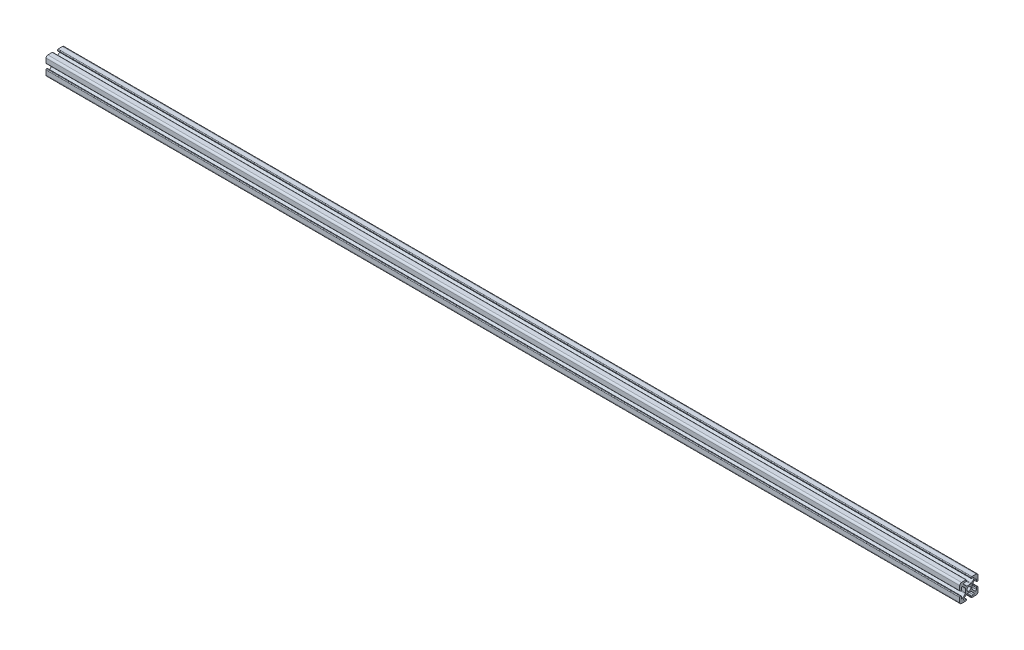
ISO-10303-21;
HEADER;
FILE_DESCRIPTION(('STEP AP214'),'2;1');
FILE_NAME('part.step','',(''),(''),'','','');
FILE_SCHEMA(('AUTOMOTIVE_DESIGN { 1 0 10303 214 1 1 1 1 }'));
ENDSEC;
DATA;
#1=APPLICATION_CONTEXT('core data for automotive mechanical design processes');
#2=APPLICATION_PROTOCOL_DEFINITION('international standard','automotive_design',2000,#1);
#3=PRODUCT_CONTEXT('',#1,'mechanical');
#4=PRODUCT('Part','Part','',(#3));
#5=PRODUCT_RELATED_PRODUCT_CATEGORY('part','',(#4));
#6=PRODUCT_DEFINITION_FORMATION('','',#4);
#7=PRODUCT_DEFINITION_CONTEXT('part definition',#1,'design');
#8=PRODUCT_DEFINITION('design','',#6,#7);
#9=PRODUCT_DEFINITION_SHAPE('','',#8);
#10=(LENGTH_UNIT() NAMED_UNIT(*) SI_UNIT(.MILLI.,.METRE.));
#11=(NAMED_UNIT(*) PLANE_ANGLE_UNIT() SI_UNIT($,.RADIAN.));
#12=(NAMED_UNIT(*) SI_UNIT($,.STERADIAN.) SOLID_ANGLE_UNIT());
#13=UNCERTAINTY_MEASURE_WITH_UNIT(LENGTH_MEASURE(1.E-05),#10,'distance_accuracy_value','');
#14=(GEOMETRIC_REPRESENTATION_CONTEXT(3) GLOBAL_UNCERTAINTY_ASSIGNED_CONTEXT((#13)) GLOBAL_UNIT_ASSIGNED_CONTEXT((#10,
#11,#12)) REPRESENTATION_CONTEXT('',''));
#15=CARTESIAN_POINT('',(0.,0.,0.));
#16=DIRECTION('',(0.,0.,1.));
#17=DIRECTION('',(1.,0.,0.));
#18=AXIS2_PLACEMENT_3D('',#15,#16,#17);
#19=CARTESIAN_POINT('',(1000.,-3.,8.69999999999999));
#20=DIRECTION('',(-1.,0.,0.));
#21=DIRECTION('',(0.,0.,1.));
#22=AXIS2_PLACEMENT_3D('',#19,#20,#21);
#23=CYLINDRICAL_SURFACE('',#22,0.500000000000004);
#24=CARTESIAN_POINT('',(0.,-3.,8.69999999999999));
#25=DIRECTION('',(1.,0.,0.));
#26=DIRECTION('',(0.,0.,-1.));
#27=AXIS2_PLACEMENT_3D('',#24,#25,#26);
#28=CIRCLE('',#27,0.500000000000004);
#29=CARTESIAN_POINT('',(0.,-3.,8.19999999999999));
#30=VERTEX_POINT('',#29);
#31=CARTESIAN_POINT('',(0.,-2.5,8.7));
#32=VERTEX_POINT('',#31);
#33=EDGE_CURVE('E742',#30,#32,#28,.T.);
#34=ORIENTED_EDGE('',*,*,#33,.T.);
#35=DIRECTION('',(-1.,0.,0.));
#36=VECTOR('',#35,1.);
#37=CARTESIAN_POINT('',(1000.,-2.5,8.7));
#38=LINE('',#37,#36);
#39=CARTESIAN_POINT('',(1000.,-2.5,8.7));
#40=VERTEX_POINT('',#39);
#41=EDGE_CURVE('E13',#40,#32,#38,.T.);
#42=ORIENTED_EDGE('',*,*,#41,.F.);
#43=CARTESIAN_POINT('',(1000.,-3.,8.69999999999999));
#44=DIRECTION('',(1.,0.,0.));
#45=DIRECTION('',(0.,0.,-1.));
#46=AXIS2_PLACEMENT_3D('',#43,#44,#45);
#47=CIRCLE('',#46,0.500000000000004);
#48=CARTESIAN_POINT('',(1000.,-3.,8.19999999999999));
#49=VERTEX_POINT('',#48);
#50=EDGE_CURVE('E1251',#49,#40,#47,.T.);
#51=ORIENTED_EDGE('',*,*,#50,.F.);
#52=DIRECTION('',(-1.,0.,0.));
#53=VECTOR('',#52,1.);
#54=CARTESIAN_POINT('',(1000.,-3.,8.19999999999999));
#55=LINE('',#54,#53);
#56=EDGE_CURVE('E735',#49,#30,#55,.T.);
#57=ORIENTED_EDGE('',*,*,#56,.T.);
#58=EDGE_LOOP('',(#34,#42,#51,#57));
#59=FACE_BOUND('',#58,.T.);
#60=ADVANCED_FACE('F258',(#59),#23,.T.);
#61=CARTESIAN_POINT('',(1000.,-2.5,8.7));
#62=DIRECTION('',(0.,-1.,0.));
#63=DIRECTION('',(0.,0.,-1.));
#64=AXIS2_PLACEMENT_3D('',#61,#62,#63);
#65=PLANE('',#64);
#66=DIRECTION('',(0.,0.,1.));
#67=VECTOR('',#66,1.);
#68=CARTESIAN_POINT('',(0.,-2.5,8.7));
#69=LINE('',#68,#67);
#70=CARTESIAN_POINT('',(0.,-2.5,9.30000000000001));
#71=VERTEX_POINT('',#70);
#72=EDGE_CURVE('E745',#32,#71,#69,.T.);
#73=ORIENTED_EDGE('',*,*,#72,.T.);
#74=DIRECTION('',(-1.,0.,0.));
#75=VECTOR('',#74,1.);
#76=CARTESIAN_POINT('',(1000.,-2.5,9.30000000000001));
#77=LINE('',#76,#75);
#78=CARTESIAN_POINT('',(1000.,-2.5,9.30000000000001));
#79=VERTEX_POINT('',#78);
#80=EDGE_CURVE('E267',#79,#71,#77,.T.);
#81=ORIENTED_EDGE('',*,*,#80,.F.);
#82=DIRECTION('',(0.,0.,1.));
#83=VECTOR('',#82,1.);
#84=CARTESIAN_POINT('',(1000.,-2.5,8.7));
#85=LINE('',#84,#83);
#86=EDGE_CURVE('E510',#40,#79,#85,.T.);
#87=ORIENTED_EDGE('',*,*,#86,.F.);
#88=ORIENTED_EDGE('',*,*,#41,.T.);
#89=EDGE_LOOP('',(#73,#81,#87,#88));
#90=FACE_BOUND('',#89,.T.);
#91=ADVANCED_FACE('F1265',(#90),#65,.F.);
#92=CARTESIAN_POINT('',(1000.,-3.2,9.3));
#93=DIRECTION('',(-1.,0.,0.));
#94=DIRECTION('',(0.,0.,1.));
#95=AXIS2_PLACEMENT_3D('',#92,#93,#94);
#96=CYLINDRICAL_SURFACE('',#95,0.699999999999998);
#97=CARTESIAN_POINT('',(0.,-3.2,9.3));
#98=DIRECTION('',(1.,0.,0.));
#99=DIRECTION('',(0.,0.,-1.));
#100=AXIS2_PLACEMENT_3D('',#97,#98,#99);
#101=CIRCLE('',#100,0.699999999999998);
#102=CARTESIAN_POINT('',(0.,-3.2,10.));
#103=VERTEX_POINT('',#102);
#104=EDGE_CURVE('E747',#71,#103,#101,.T.);
#105=ORIENTED_EDGE('',*,*,#104,.T.);
#106=DIRECTION('',(-1.,0.,0.));
#107=VECTOR('',#106,1.);
#108=CARTESIAN_POINT('',(1000.,-3.2,10.));
#109=LINE('',#108,#107);
#110=CARTESIAN_POINT('',(1000.,-3.2,10.));
#111=VERTEX_POINT('',#110);
#112=EDGE_CURVE('E1083',#111,#103,#109,.T.);
#113=ORIENTED_EDGE('',*,*,#112,.F.);
#114=CARTESIAN_POINT('',(1000.,-3.2,9.3));
#115=DIRECTION('',(1.,0.,0.));
#116=DIRECTION('',(0.,0.,-1.));
#117=AXIS2_PLACEMENT_3D('',#114,#115,#116);
#118=CIRCLE('',#117,0.699999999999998);
#119=EDGE_CURVE('E1091',#79,#111,#118,.T.);
#120=ORIENTED_EDGE('',*,*,#119,.F.);
#121=ORIENTED_EDGE('',*,*,#80,.T.);
#122=EDGE_LOOP('',(#105,#113,#120,#121));
#123=FACE_BOUND('',#122,.T.);
#124=ADVANCED_FACE('F1089',(#123),#96,.T.);
#125=CARTESIAN_POINT('',(1000.,-3.2,10.));
#126=DIRECTION('',(0.,0.,-1.));
#127=DIRECTION('',(-1.,0.,0.));
#128=AXIS2_PLACEMENT_3D('',#125,#126,#127);
#129=PLANE('',#128);
#130=DIRECTION('',(0.,-1.,0.));
#131=VECTOR('',#130,1.);
#132=CARTESIAN_POINT('',(0.,-3.2,10.));
#133=LINE('',#132,#131);
#134=CARTESIAN_POINT('',(0.,-8.,10.));
#135=VERTEX_POINT('',#134);
#136=EDGE_CURVE('E749',#103,#135,#133,.T.);
#137=ORIENTED_EDGE('',*,*,#136,.T.);
#138=DIRECTION('',(-1.,0.,0.));
#139=VECTOR('',#138,1.);
#140=CARTESIAN_POINT('',(1000.,-8.,10.));
#141=LINE('',#140,#139);
#142=CARTESIAN_POINT('',(1000.,-8.,10.));
#143=VERTEX_POINT('',#142);
#144=EDGE_CURVE('E1080',#143,#135,#141,.T.);
#145=ORIENTED_EDGE('',*,*,#144,.F.);
#146=DIRECTION('',(0.,-1.,0.));
#147=VECTOR('',#146,1.);
#148=CARTESIAN_POINT('',(1000.,-3.2,10.));
#149=LINE('',#148,#147);
#150=EDGE_CURVE('E1109',#111,#143,#149,.T.);
#151=ORIENTED_EDGE('',*,*,#150,.F.);
#152=ORIENTED_EDGE('',*,*,#112,.T.);
#153=EDGE_LOOP('',(#137,#145,#151,#152));
#154=FACE_BOUND('',#153,.T.);
#155=ADVANCED_FACE('F1100',(#154),#129,.F.);
#156=CARTESIAN_POINT('',(1000.,-8.,8.));
#157=DIRECTION('',(-1.,0.,0.));
#158=DIRECTION('',(0.,0.,1.));
#159=AXIS2_PLACEMENT_3D('',#156,#157,#158);
#160=CYLINDRICAL_SURFACE('',#159,2.);
#161=CARTESIAN_POINT('',(0.,-8.,8.));
#162=DIRECTION('',(1.,0.,0.));
#163=DIRECTION('',(0.,0.,-1.));
#164=AXIS2_PLACEMENT_3D('',#161,#162,#163);
#165=CIRCLE('',#164,2.);
#166=CARTESIAN_POINT('',(0.,-10.,8.));
#167=VERTEX_POINT('',#166);
#168=EDGE_CURVE('E751',#135,#167,#165,.T.);
#169=ORIENTED_EDGE('',*,*,#168,.T.);
#170=DIRECTION('',(-1.,0.,0.));
#171=VECTOR('',#170,1.);
#172=CARTESIAN_POINT('',(1000.,-10.,8.));
#173=LINE('',#172,#171);
#174=CARTESIAN_POINT('',(1000.,-10.,8.));
#175=VERTEX_POINT('',#174);
#176=EDGE_CURVE('E1077',#175,#167,#173,.T.);
#177=ORIENTED_EDGE('',*,*,#176,.F.);
#178=CARTESIAN_POINT('',(1000.,-8.,8.));
#179=DIRECTION('',(1.,0.,0.));
#180=DIRECTION('',(0.,0.,-1.));
#181=AXIS2_PLACEMENT_3D('',#178,#179,#180);
#182=CIRCLE('',#181,2.);
#183=EDGE_CURVE('E1106',#143,#175,#182,.T.);
#184=ORIENTED_EDGE('',*,*,#183,.F.);
#185=ORIENTED_EDGE('',*,*,#144,.T.);
#186=EDGE_LOOP('',(#169,#177,#184,#185));
#187=FACE_BOUND('',#186,.T.);
#188=ADVANCED_FACE('F1104',(#187),#160,.T.);
#189=CARTESIAN_POINT('',(1000.,-10.,8.));
#190=DIRECTION('',(0.,1.,0.));
#191=DIRECTION('',(0.,0.,1.));
#192=AXIS2_PLACEMENT_3D('',#189,#190,#191);
#193=PLANE('',#192);
#194=DIRECTION('',(0.,0.,-1.));
#195=VECTOR('',#194,1.);
#196=CARTESIAN_POINT('',(0.,-10.,8.));
#197=LINE('',#196,#195);
#198=CARTESIAN_POINT('',(0.,-10.,3.2));
#199=VERTEX_POINT('',#198);
#200=EDGE_CURVE('E753',#167,#199,#197,.T.);
#201=ORIENTED_EDGE('',*,*,#200,.T.);
#202=DIRECTION('',(-1.,0.,0.));
#203=VECTOR('',#202,1.);
#204=CARTESIAN_POINT('',(1000.,-10.,3.2));
#205=LINE('',#204,#203);
#206=CARTESIAN_POINT('',(1000.,-10.,3.2));
#207=VERTEX_POINT('',#206);
#208=EDGE_CURVE('E1074',#207,#199,#205,.T.);
#209=ORIENTED_EDGE('',*,*,#208,.F.);
#210=DIRECTION('',(0.,0.,-1.));
#211=VECTOR('',#210,1.);
#212=CARTESIAN_POINT('',(1000.,-10.,8.));
#213=LINE('',#212,#211);
#214=EDGE_CURVE('E1108',#175,#207,#213,.T.);
#215=ORIENTED_EDGE('',*,*,#214,.F.);
#216=ORIENTED_EDGE('',*,*,#176,.T.);
#217=EDGE_LOOP('',(#201,#209,#215,#216));
#218=FACE_BOUND('',#217,.T.);
#219=ADVANCED_FACE('F1277',(#218),#193,.F.);
#220=CARTESIAN_POINT('',(1000.,-9.3,3.2));
#221=DIRECTION('',(-1.,0.,0.));
#222=DIRECTION('',(0.,0.,1.));
#223=AXIS2_PLACEMENT_3D('',#220,#221,#222);
#224=CYLINDRICAL_SURFACE('',#223,0.699999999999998);
#225=CARTESIAN_POINT('',(0.,-9.3,3.2));
#226=DIRECTION('',(1.,0.,0.));
#227=DIRECTION('',(0.,0.,-1.));
#228=AXIS2_PLACEMENT_3D('',#225,#226,#227);
#229=CIRCLE('',#228,0.699999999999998);
#230=CARTESIAN_POINT('',(0.,-9.30000000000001,2.5));
#231=VERTEX_POINT('',#230);
#232=EDGE_CURVE('E755',#199,#231,#229,.T.);
#233=ORIENTED_EDGE('',*,*,#232,.T.);
#234=DIRECTION('',(-1.,0.,0.));
#235=VECTOR('',#234,1.);
#236=CARTESIAN_POINT('',(1000.,-9.30000000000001,2.5));
#237=LINE('',#236,#235);
#238=CARTESIAN_POINT('',(1000.,-9.30000000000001,2.5));
#239=VERTEX_POINT('',#238);
#240=EDGE_CURVE('E1071',#239,#231,#237,.T.);
#241=ORIENTED_EDGE('',*,*,#240,.F.);
#242=CARTESIAN_POINT('',(1000.,-9.3,3.2));
#243=DIRECTION('',(1.,0.,0.));
#244=DIRECTION('',(0.,0.,-1.));
#245=AXIS2_PLACEMENT_3D('',#242,#243,#244);
#246=CIRCLE('',#245,0.699999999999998);
#247=EDGE_CURVE('E1111',#207,#239,#246,.T.);
#248=ORIENTED_EDGE('',*,*,#247,.F.);
#249=ORIENTED_EDGE('',*,*,#208,.T.);
#250=EDGE_LOOP('',(#233,#241,#248,#249));
#251=FACE_BOUND('',#250,.T.);
#252=ADVANCED_FACE('F1280',(#251),#224,.T.);
#253=CARTESIAN_POINT('',(1000.,-9.30000000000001,2.5));
#254=DIRECTION('',(0.,0.,1.));
#255=DIRECTION('',(1.,0.,0.));
#256=AXIS2_PLACEMENT_3D('',#253,#254,#255);
#257=PLANE('',#256);
#258=DIRECTION('',(0.,1.,0.));
#259=VECTOR('',#258,1.);
#260=CARTESIAN_POINT('',(0.,-9.30000000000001,2.5));
#261=LINE('',#260,#259);
#262=CARTESIAN_POINT('',(0.,-8.7,2.5));
#263=VERTEX_POINT('',#262);
#264=EDGE_CURVE('E757',#231,#263,#261,.T.);
#265=ORIENTED_EDGE('',*,*,#264,.T.);
#266=DIRECTION('',(-1.,0.,0.));
#267=VECTOR('',#266,1.);
#268=CARTESIAN_POINT('',(1000.,-8.7,2.5));
#269=LINE('',#268,#267);
#270=CARTESIAN_POINT('',(1000.,-8.7,2.5));
#271=VERTEX_POINT('',#270);
#272=EDGE_CURVE('E1068',#271,#263,#269,.T.);
#273=ORIENTED_EDGE('',*,*,#272,.F.);
#274=DIRECTION('',(0.,1.,0.));
#275=VECTOR('',#274,1.);
#276=CARTESIAN_POINT('',(1000.,-9.30000000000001,2.5));
#277=LINE('',#276,#275);
#278=EDGE_CURVE('E1117',#239,#271,#277,.T.);
#279=ORIENTED_EDGE('',*,*,#278,.F.);
#280=ORIENTED_EDGE('',*,*,#240,.T.);
#281=EDGE_LOOP('',(#265,#273,#279,#280));
#282=FACE_BOUND('',#281,.T.);
#283=ADVANCED_FACE('F1284',(#282),#257,.F.);
#284=CARTESIAN_POINT('',(1000.,-8.7,2.99999999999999));
#285=DIRECTION('',(-1.,0.,0.));
#286=DIRECTION('',(0.,0.,1.));
#287=AXIS2_PLACEMENT_3D('',#284,#285,#286);
#288=CYLINDRICAL_SURFACE('',#287,0.499999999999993);
#289=CARTESIAN_POINT('',(0.,-8.7,2.99999999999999));
#290=DIRECTION('',(1.,0.,0.));
#291=DIRECTION('',(0.,0.,-1.));
#292=AXIS2_PLACEMENT_3D('',#289,#290,#291);
#293=CIRCLE('',#292,0.499999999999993);
#294=CARTESIAN_POINT('',(0.,-8.2,3.));
#295=VERTEX_POINT('',#294);
#296=EDGE_CURVE('E759',#263,#295,#293,.T.);
#297=ORIENTED_EDGE('',*,*,#296,.T.);
#298=DIRECTION('',(-1.,0.,0.));
#299=VECTOR('',#298,1.);
#300=CARTESIAN_POINT('',(1000.,-8.2,3.));
#301=LINE('',#300,#299);
#302=CARTESIAN_POINT('',(1000.,-8.2,3.));
#303=VERTEX_POINT('',#302);
#304=EDGE_CURVE('E1065',#303,#295,#301,.T.);
#305=ORIENTED_EDGE('',*,*,#304,.F.);
#306=CARTESIAN_POINT('',(1000.,-8.7,2.99999999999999));
#307=DIRECTION('',(1.,0.,0.));
#308=DIRECTION('',(0.,0.,-1.));
#309=AXIS2_PLACEMENT_3D('',#306,#307,#308);
#310=CIRCLE('',#309,0.499999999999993);
#311=EDGE_CURVE('E1119',#271,#303,#310,.T.);
#312=ORIENTED_EDGE('',*,*,#311,.F.);
#313=ORIENTED_EDGE('',*,*,#272,.T.);
#314=EDGE_LOOP('',(#297,#305,#312,#313));
#315=FACE_BOUND('',#314,.T.);
#316=ADVANCED_FACE('F1288',(#315),#288,.T.);
#317=CARTESIAN_POINT('',(1000.,-8.2,3.));
#318=DIRECTION('',(0.,-1.,0.));
#319=DIRECTION('',(0.,0.,-1.));
#320=AXIS2_PLACEMENT_3D('',#317,#318,#319);
#321=PLANE('',#320);
#322=DIRECTION('',(0.,0.,1.));
#323=VECTOR('',#322,1.);
#324=CARTESIAN_POINT('',(0.,-8.2,3.));
#325=LINE('',#324,#323);
#326=CARTESIAN_POINT('',(0.,-8.2,4.86758838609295));
#327=VERTEX_POINT('',#326);
#328=EDGE_CURVE('E761',#295,#327,#325,.T.);
#329=ORIENTED_EDGE('',*,*,#328,.T.);
#330=DIRECTION('',(-1.,0.,0.));
#331=VECTOR('',#330,1.);
#332=CARTESIAN_POINT('',(1000.,-8.2,4.86758838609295));
#333=LINE('',#332,#331);
#334=CARTESIAN_POINT('',(1000.,-8.2,4.86758838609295));
#335=VERTEX_POINT('',#334);
#336=EDGE_CURVE('E1062',#335,#327,#333,.T.);
#337=ORIENTED_EDGE('',*,*,#336,.F.);
#338=DIRECTION('',(0.,0.,1.));
#339=VECTOR('',#338,1.);
#340=CARTESIAN_POINT('',(1000.,-8.2,3.));
#341=LINE('',#340,#339);
#342=EDGE_CURVE('E1121',#303,#335,#341,.T.);
#343=ORIENTED_EDGE('',*,*,#342,.F.);
#344=ORIENTED_EDGE('',*,*,#304,.T.);
#345=EDGE_LOOP('',(#329,#337,#343,#344));
#346=FACE_BOUND('',#345,.T.);
#347=ADVANCED_FACE('F1292',(#346),#321,.F.);
#348=CARTESIAN_POINT('',(1000.,-7.31758838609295,4.86758838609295));
#349=DIRECTION('',(-1.,0.,0.));
#350=DIRECTION('',(0.,0.,1.));
#351=AXIS2_PLACEMENT_3D('',#348,#349,#350);
#352=CYLINDRICAL_SURFACE('',#351,0.882411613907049);
#353=CARTESIAN_POINT('',(0.,-7.31758838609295,4.86758838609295));
#354=DIRECTION('',(-1.,0.,0.));
#355=DIRECTION('',(0.,0.,-1.));
#356=AXIS2_PLACEMENT_3D('',#353,#354,#355);
#357=CIRCLE('',#356,0.882411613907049);
#358=CARTESIAN_POINT('',(0.,-6.69362915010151,5.4915476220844));
#359=VERTEX_POINT('',#358);
#360=EDGE_CURVE('E763',#327,#359,#357,.T.);
#361=ORIENTED_EDGE('',*,*,#360,.T.);
#362=DIRECTION('',(-1.,0.,0.));
#363=VECTOR('',#362,1.);
#364=CARTESIAN_POINT('',(1000.,-6.69362915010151,5.4915476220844));
#365=LINE('',#364,#363);
#366=CARTESIAN_POINT('',(1000.,-6.69362915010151,5.4915476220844));
#367=VERTEX_POINT('',#366);
#368=EDGE_CURVE('E1059',#367,#359,#365,.T.);
#369=ORIENTED_EDGE('',*,*,#368,.F.);
#370=CARTESIAN_POINT('',(1000.,-7.31758838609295,4.86758838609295));
#371=DIRECTION('',(-1.,0.,0.));
#372=DIRECTION('',(0.,0.,-1.));
#373=AXIS2_PLACEMENT_3D('',#370,#371,#372);
#374=CIRCLE('',#373,0.882411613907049);
#375=EDGE_CURVE('E1123',#335,#367,#374,.T.);
#376=ORIENTED_EDGE('',*,*,#375,.F.);
#377=ORIENTED_EDGE('',*,*,#336,.T.);
#378=EDGE_LOOP('',(#361,#369,#376,#377));
#379=FACE_BOUND('',#378,.T.);
#380=ADVANCED_FACE('F1296',(#379),#352,.F.);
#381=CARTESIAN_POINT('',(1000.,-6.69362915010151,5.4915476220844));
#382=DIRECTION('',(0.,0.707106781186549,0.707106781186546));
#383=DIRECTION('',(0.,-0.707106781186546,0.707106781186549));
#384=AXIS2_PLACEMENT_3D('',#381,#382,#383);
#385=PLANE('',#384);
#386=DIRECTION('',(0.,0.707106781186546,-0.707106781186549));
#387=VECTOR('',#386,1.);
#388=CARTESIAN_POINT('',(0.,-6.69362915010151,5.4915476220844));
#389=LINE('',#388,#387);
#390=CARTESIAN_POINT('',(0.,-3.94289321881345,2.74081169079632));
#391=VERTEX_POINT('',#390);
#392=EDGE_CURVE('E765',#359,#391,#389,.T.);
#393=ORIENTED_EDGE('',*,*,#392,.T.);
#394=DIRECTION('',(-1.,0.,0.));
#395=VECTOR('',#394,1.);
#396=CARTESIAN_POINT('',(1000.,-3.94289321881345,2.74081169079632));
#397=LINE('',#396,#395);
#398=CARTESIAN_POINT('',(1000.,-3.94289321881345,2.74081169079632));
#399=VERTEX_POINT('',#398);
#400=EDGE_CURVE('E1056',#399,#391,#397,.T.);
#401=ORIENTED_EDGE('',*,*,#400,.F.);
#402=DIRECTION('',(0.,0.707106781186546,-0.707106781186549));
#403=VECTOR('',#402,1.);
#404=CARTESIAN_POINT('',(1000.,-6.69362915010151,5.4915476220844));
#405=LINE('',#404,#403);
#406=EDGE_CURVE('E1125',#367,#399,#405,.T.);
#407=ORIENTED_EDGE('',*,*,#406,.F.);
#408=ORIENTED_EDGE('',*,*,#368,.T.);
#409=EDGE_LOOP('',(#393,#401,#407,#408));
#410=FACE_BOUND('',#409,.T.);
#411=ADVANCED_FACE('F1300',(#410),#385,.F.);
#412=CARTESIAN_POINT('',(1000.,-4.65,2.03370490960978));
#413=DIRECTION('',(-1.,0.,0.));
#414=DIRECTION('',(0.,0.,1.));
#415=AXIS2_PLACEMENT_3D('',#412,#413,#414);
#416=CYLINDRICAL_SURFACE('',#415,0.999999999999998);
#417=CARTESIAN_POINT('',(0.,-4.65,2.03370490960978));
#418=DIRECTION('',(-1.,0.,0.));
#419=DIRECTION('',(0.,0.,-1.));
#420=AXIS2_PLACEMENT_3D('',#417,#418,#419);
#421=CIRCLE('',#420,0.999999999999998);
#422=CARTESIAN_POINT('',(0.,-3.65000000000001,2.03370490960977));
#423=VERTEX_POINT('',#422);
#424=EDGE_CURVE('E767',#391,#423,#421,.T.);
#425=ORIENTED_EDGE('',*,*,#424,.T.);
#426=DIRECTION('',(-1.,0.,0.));
#427=VECTOR('',#426,1.);
#428=CARTESIAN_POINT('',(1000.,-3.65000000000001,2.03370490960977));
#429=LINE('',#428,#427);
#430=CARTESIAN_POINT('',(1000.,-3.65000000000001,2.03370490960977));
#431=VERTEX_POINT('',#430);
#432=EDGE_CURVE('E1053',#431,#423,#429,.T.);
#433=ORIENTED_EDGE('',*,*,#432,.F.);
#434=CARTESIAN_POINT('',(1000.,-4.65,2.03370490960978));
#435=DIRECTION('',(-1.,0.,0.));
#436=DIRECTION('',(0.,0.,-1.));
#437=AXIS2_PLACEMENT_3D('',#434,#435,#436);
#438=CIRCLE('',#437,0.999999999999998);
#439=EDGE_CURVE('E1127',#399,#431,#438,.T.);
#440=ORIENTED_EDGE('',*,*,#439,.F.);
#441=ORIENTED_EDGE('',*,*,#400,.T.);
#442=EDGE_LOOP('',(#425,#433,#440,#441));
#443=FACE_BOUND('',#442,.T.);
#444=ADVANCED_FACE('F1304',(#443),#416,.F.);
#445=CARTESIAN_POINT('',(1000.,-3.65000000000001,2.03370490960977));
#446=DIRECTION('',(0.,1.,0.));
#447=DIRECTION('',(0.,0.,1.));
#448=AXIS2_PLACEMENT_3D('',#445,#446,#447);
#449=PLANE('',#448);
#450=DIRECTION('',(0.,0.,-1.));
#451=VECTOR('',#450,1.);
#452=CARTESIAN_POINT('',(0.,-3.65000000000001,2.03370490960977));
#453=LINE('',#452,#451);
#454=CARTESIAN_POINT('',(0.,-3.64999999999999,-2.03370490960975));
#455=VERTEX_POINT('',#454);
#456=EDGE_CURVE('E769',#423,#455,#453,.T.);
#457=ORIENTED_EDGE('',*,*,#456,.T.);
#458=DIRECTION('',(-1.,0.,0.));
#459=VECTOR('',#458,1.);
#460=CARTESIAN_POINT('',(1000.,-3.64999999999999,-2.03370490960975));
#461=LINE('',#460,#459);
#462=CARTESIAN_POINT('',(1000.,-3.64999999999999,-2.03370490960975));
#463=VERTEX_POINT('',#462);
#464=EDGE_CURVE('E1050',#463,#455,#461,.T.);
#465=ORIENTED_EDGE('',*,*,#464,.F.);
#466=DIRECTION('',(0.,0.,-1.));
#467=VECTOR('',#466,1.);
#468=CARTESIAN_POINT('',(1000.,-3.65000000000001,2.03370490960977));
#469=LINE('',#468,#467);
#470=EDGE_CURVE('E1129',#431,#463,#469,.T.);
#471=ORIENTED_EDGE('',*,*,#470,.F.);
#472=ORIENTED_EDGE('',*,*,#432,.T.);
#473=EDGE_LOOP('',(#457,#465,#471,#472));
#474=FACE_BOUND('',#473,.T.);
#475=ADVANCED_FACE('F1308',(#474),#449,.F.);
#476=CARTESIAN_POINT('',(1000.,-4.65,-2.03370490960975));
#477=DIRECTION('',(-1.,0.,0.));
#478=DIRECTION('',(0.,0.,1.));
#479=AXIS2_PLACEMENT_3D('',#476,#477,#478);
#480=CYLINDRICAL_SURFACE('',#479,1.00000000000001);
#481=CARTESIAN_POINT('',(0.,-4.65,-2.03370490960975));
#482=DIRECTION('',(-1.,0.,0.));
#483=DIRECTION('',(0.,0.,-1.));
#484=AXIS2_PLACEMENT_3D('',#481,#482,#483);
#485=CIRCLE('',#484,1.00000000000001);
#486=CARTESIAN_POINT('',(0.,-3.94289321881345,-2.74081169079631));
#487=VERTEX_POINT('',#486);
#488=EDGE_CURVE('E771',#455,#487,#485,.T.);
#489=ORIENTED_EDGE('',*,*,#488,.T.);
#490=DIRECTION('',(-1.,0.,0.));
#491=VECTOR('',#490,1.);
#492=CARTESIAN_POINT('',(1000.,-3.94289321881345,-2.74081169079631));
#493=LINE('',#492,#491);
#494=CARTESIAN_POINT('',(1000.,-3.94289321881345,-2.74081169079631));
#495=VERTEX_POINT('',#494);
#496=EDGE_CURVE('E1047',#495,#487,#493,.T.);
#497=ORIENTED_EDGE('',*,*,#496,.F.);
#498=CARTESIAN_POINT('',(1000.,-4.65,-2.03370490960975));
#499=DIRECTION('',(-1.,0.,0.));
#500=DIRECTION('',(0.,0.,-1.));
#501=AXIS2_PLACEMENT_3D('',#498,#499,#500);
#502=CIRCLE('',#501,1.00000000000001);
#503=EDGE_CURVE('E1131',#463,#495,#502,.T.);
#504=ORIENTED_EDGE('',*,*,#503,.F.);
#505=ORIENTED_EDGE('',*,*,#464,.T.);
#506=EDGE_LOOP('',(#489,#497,#504,#505));
#507=FACE_BOUND('',#506,.T.);
#508=ADVANCED_FACE('F1312',(#507),#480,.F.);
#509=CARTESIAN_POINT('',(1000.,-3.94289321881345,-2.74081169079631));
#510=DIRECTION('',(0.,0.707106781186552,-0.707106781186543));
#511=DIRECTION('',(0.,0.707106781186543,0.707106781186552));
#512=AXIS2_PLACEMENT_3D('',#509,#510,#511);
#513=PLANE('',#512);
#514=DIRECTION('',(0.,-0.707106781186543,-0.707106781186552));
#515=VECTOR('',#514,1.);
#516=CARTESIAN_POINT('',(0.,-3.94289321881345,-2.74081169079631));
#517=LINE('',#516,#515);
#518=CARTESIAN_POINT('',(0.,-6.69362915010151,-5.4915476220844));
#519=VERTEX_POINT('',#518);
#520=EDGE_CURVE('E773',#487,#519,#517,.T.);
#521=ORIENTED_EDGE('',*,*,#520,.T.);
#522=DIRECTION('',(-1.,0.,0.));
#523=VECTOR('',#522,1.);
#524=CARTESIAN_POINT('',(1000.,-6.69362915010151,-5.4915476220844));
#525=LINE('',#524,#523);
#526=CARTESIAN_POINT('',(1000.,-6.69362915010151,-5.4915476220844));
#527=VERTEX_POINT('',#526);
#528=EDGE_CURVE('E1044',#527,#519,#525,.T.);
#529=ORIENTED_EDGE('',*,*,#528,.F.);
#530=DIRECTION('',(0.,-0.707106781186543,-0.707106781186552));
#531=VECTOR('',#530,1.);
#532=CARTESIAN_POINT('',(1000.,-3.94289321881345,-2.74081169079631));
#533=LINE('',#532,#531);
#534=EDGE_CURVE('E1133',#495,#527,#533,.T.);
#535=ORIENTED_EDGE('',*,*,#534,.F.);
#536=ORIENTED_EDGE('',*,*,#496,.T.);
#537=EDGE_LOOP('',(#521,#529,#535,#536));
#538=FACE_BOUND('',#537,.T.);
#539=ADVANCED_FACE('F1316',(#538),#513,.F.);
#540=CARTESIAN_POINT('',(1000.,-7.31758838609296,-4.86758838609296));
#541=DIRECTION('',(-1.,0.,0.));
#542=DIRECTION('',(0.,0.,1.));
#543=AXIS2_PLACEMENT_3D('',#540,#541,#542);
#544=CYLINDRICAL_SURFACE('',#543,0.882411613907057);
#545=CARTESIAN_POINT('',(0.,-7.31758838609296,-4.86758838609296));
#546=DIRECTION('',(-1.,0.,0.));
#547=DIRECTION('',(0.,0.,-1.));
#548=AXIS2_PLACEMENT_3D('',#545,#546,#547);
#549=CIRCLE('',#548,0.882411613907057);
#550=CARTESIAN_POINT('',(0.,-8.20000000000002,-4.86758838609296));
#551=VERTEX_POINT('',#550);
#552=EDGE_CURVE('E775',#519,#551,#549,.T.);
#553=ORIENTED_EDGE('',*,*,#552,.T.);
#554=DIRECTION('',(-1.,0.,0.));
#555=VECTOR('',#554,1.);
#556=CARTESIAN_POINT('',(1000.,-8.20000000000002,-4.86758838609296));
#557=LINE('',#556,#555);
#558=CARTESIAN_POINT('',(1000.,-8.20000000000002,-4.86758838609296));
#559=VERTEX_POINT('',#558);
#560=EDGE_CURVE('E1041',#559,#551,#557,.T.);
#561=ORIENTED_EDGE('',*,*,#560,.F.);
#562=CARTESIAN_POINT('',(1000.,-7.31758838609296,-4.86758838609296));
#563=DIRECTION('',(-1.,0.,0.));
#564=DIRECTION('',(0.,0.,-1.));
#565=AXIS2_PLACEMENT_3D('',#562,#563,#564);
#566=CIRCLE('',#565,0.882411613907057);
#567=EDGE_CURVE('E1135',#527,#559,#566,.T.);
#568=ORIENTED_EDGE('',*,*,#567,.F.);
#569=ORIENTED_EDGE('',*,*,#528,.T.);
#570=EDGE_LOOP('',(#553,#561,#568,#569));
#571=FACE_BOUND('',#570,.T.);
#572=ADVANCED_FACE('F1320',(#571),#544,.F.);
#573=CARTESIAN_POINT('',(1000.,-8.20000000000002,-4.86758838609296));
#574=DIRECTION('',(0.,-1.,0.));
#575=DIRECTION('',(0.,0.,-1.));
#576=AXIS2_PLACEMENT_3D('',#573,#574,#575);
#577=PLANE('',#576);
#578=DIRECTION('',(0.,0.,1.));
#579=VECTOR('',#578,1.);
#580=CARTESIAN_POINT('',(0.,-8.20000000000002,-4.86758838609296));
#581=LINE('',#580,#579);
#582=CARTESIAN_POINT('',(0.,-8.19999999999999,-3.));
#583=VERTEX_POINT('',#582);
#584=EDGE_CURVE('E777',#551,#583,#581,.T.);
#585=ORIENTED_EDGE('',*,*,#584,.T.);
#586=DIRECTION('',(-1.,0.,0.));
#587=VECTOR('',#586,1.);
#588=CARTESIAN_POINT('',(1000.,-8.19999999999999,-3.));
#589=LINE('',#588,#587);
#590=CARTESIAN_POINT('',(1000.,-8.19999999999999,-3.));
#591=VERTEX_POINT('',#590);
#592=EDGE_CURVE('E1038',#591,#583,#589,.T.);
#593=ORIENTED_EDGE('',*,*,#592,.F.);
#594=DIRECTION('',(0.,0.,1.));
#595=VECTOR('',#594,1.);
#596=CARTESIAN_POINT('',(1000.,-8.20000000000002,-4.86758838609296));
#597=LINE('',#596,#595);
#598=EDGE_CURVE('E1137',#559,#591,#597,.T.);
#599=ORIENTED_EDGE('',*,*,#598,.F.);
#600=ORIENTED_EDGE('',*,*,#560,.T.);
#601=EDGE_LOOP('',(#585,#593,#599,#600));
#602=FACE_BOUND('',#601,.T.);
#603=ADVANCED_FACE('F1324',(#602),#577,.F.);
#604=CARTESIAN_POINT('',(1000.,-8.7,-3.00000000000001));
#605=DIRECTION('',(-1.,0.,0.));
#606=DIRECTION('',(0.,0.,1.));
#607=AXIS2_PLACEMENT_3D('',#604,#605,#606);
#608=CYLINDRICAL_SURFACE('',#607,0.500000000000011);
#609=CARTESIAN_POINT('',(0.,-8.7,-3.00000000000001));
#610=DIRECTION('',(1.,0.,0.));
#611=DIRECTION('',(0.,0.,-1.));
#612=AXIS2_PLACEMENT_3D('',#609,#610,#611);
#613=CIRCLE('',#612,0.500000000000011);
#614=CARTESIAN_POINT('',(0.,-8.7,-2.5));
#615=VERTEX_POINT('',#614);
#616=EDGE_CURVE('E779',#583,#615,#613,.T.);
#617=ORIENTED_EDGE('',*,*,#616,.T.);
#618=DIRECTION('',(-1.,0.,0.));
#619=VECTOR('',#618,1.);
#620=CARTESIAN_POINT('',(1000.,-8.7,-2.5));
#621=LINE('',#620,#619);
#622=CARTESIAN_POINT('',(1000.,-8.7,-2.5));
#623=VERTEX_POINT('',#622);
#624=EDGE_CURVE('E1035',#623,#615,#621,.T.);
#625=ORIENTED_EDGE('',*,*,#624,.F.);
#626=CARTESIAN_POINT('',(1000.,-8.7,-3.00000000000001));
#627=DIRECTION('',(1.,0.,0.));
#628=DIRECTION('',(0.,0.,-1.));
#629=AXIS2_PLACEMENT_3D('',#626,#627,#628);
#630=CIRCLE('',#629,0.500000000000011);
#631=EDGE_CURVE('E1139',#591,#623,#630,.T.);
#632=ORIENTED_EDGE('',*,*,#631,.F.);
#633=ORIENTED_EDGE('',*,*,#592,.T.);
#634=EDGE_LOOP('',(#617,#625,#632,#633));
#635=FACE_BOUND('',#634,.T.);
#636=ADVANCED_FACE('F1328',(#635),#608,.T.);
#637=CARTESIAN_POINT('',(1000.,-8.7,-2.5));
#638=DIRECTION('',(0.,0.,-1.));
#639=DIRECTION('',(-1.,0.,0.));
#640=AXIS2_PLACEMENT_3D('',#637,#638,#639);
#641=PLANE('',#640);
#642=DIRECTION('',(0.,-1.,0.));
#643=VECTOR('',#642,1.);
#644=CARTESIAN_POINT('',(0.,-8.7,-2.5));
#645=LINE('',#644,#643);
#646=CARTESIAN_POINT('',(0.,-9.30000000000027,-2.5));
#647=VERTEX_POINT('',#646);
#648=EDGE_CURVE('E781',#615,#647,#645,.T.);
#649=ORIENTED_EDGE('',*,*,#648,.T.);
#650=DIRECTION('',(-1.,0.,0.));
#651=VECTOR('',#650,1.);
#652=CARTESIAN_POINT('',(1000.,-9.30000000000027,-2.5));
#653=LINE('',#652,#651);
#654=CARTESIAN_POINT('',(1000.,-9.30000000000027,-2.5));
#655=VERTEX_POINT('',#654);
#656=EDGE_CURVE('E1032',#655,#647,#653,.T.);
#657=ORIENTED_EDGE('',*,*,#656,.F.);
#658=DIRECTION('',(0.,-1.,0.));
#659=VECTOR('',#658,1.);
#660=CARTESIAN_POINT('',(1000.,-8.7,-2.5));
#661=LINE('',#660,#659);
#662=EDGE_CURVE('E1141',#623,#655,#661,.T.);
#663=ORIENTED_EDGE('',*,*,#662,.F.);
#664=ORIENTED_EDGE('',*,*,#624,.T.);
#665=EDGE_LOOP('',(#649,#657,#663,#664));
#666=FACE_BOUND('',#665,.T.);
#667=ADVANCED_FACE('F1332',(#666),#641,.F.);
#668=CARTESIAN_POINT('',(1000.,-9.30000000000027,-3.2));
#669=DIRECTION('',(-1.,0.,0.));
#670=DIRECTION('',(0.,0.,1.));
#671=AXIS2_PLACEMENT_3D('',#668,#669,#670);
#672=CYLINDRICAL_SURFACE('',#671,0.699999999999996);
#673=CARTESIAN_POINT('',(0.,-9.30000000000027,-3.2));
#674=DIRECTION('',(1.,0.,0.));
#675=DIRECTION('',(0.,0.,-1.));
#676=AXIS2_PLACEMENT_3D('',#673,#674,#675);
#677=CIRCLE('',#676,0.699999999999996);
#678=CARTESIAN_POINT('',(0.,-10.0000000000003,-3.19999999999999));
#679=VERTEX_POINT('',#678);
#680=EDGE_CURVE('E783',#647,#679,#677,.T.);
#681=ORIENTED_EDGE('',*,*,#680,.T.);
#682=DIRECTION('',(-1.,0.,0.));
#683=VECTOR('',#682,1.);
#684=CARTESIAN_POINT('',(1000.,-10.0000000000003,-3.19999999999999));
#685=LINE('',#684,#683);
#686=CARTESIAN_POINT('',(1000.,-10.0000000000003,-3.19999999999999));
#687=VERTEX_POINT('',#686);
#688=EDGE_CURVE('E1029',#687,#679,#685,.T.);
#689=ORIENTED_EDGE('',*,*,#688,.F.);
#690=CARTESIAN_POINT('',(1000.,-9.30000000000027,-3.2));
#691=DIRECTION('',(1.,0.,0.));
#692=DIRECTION('',(0.,0.,-1.));
#693=AXIS2_PLACEMENT_3D('',#690,#691,#692);
#694=CIRCLE('',#693,0.699999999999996);
#695=EDGE_CURVE('E1143',#655,#687,#694,.T.);
#696=ORIENTED_EDGE('',*,*,#695,.F.);
#697=ORIENTED_EDGE('',*,*,#656,.T.);
#698=EDGE_LOOP('',(#681,#689,#696,#697));
#699=FACE_BOUND('',#698,.T.);
#700=ADVANCED_FACE('F1336',(#699),#672,.T.);
#701=CARTESIAN_POINT('',(1000.,-10.0000000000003,-3.19999999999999));
#702=DIRECTION('',(0.,1.,0.));
#703=DIRECTION('',(0.,0.,1.));
#704=AXIS2_PLACEMENT_3D('',#701,#702,#703);
#705=PLANE('',#704);
#706=DIRECTION('',(0.,0.,-1.));
#707=VECTOR('',#706,1.);
#708=CARTESIAN_POINT('',(0.,-10.0000000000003,-3.19999999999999));
#709=LINE('',#708,#707);
#710=CARTESIAN_POINT('',(0.,-10.0000000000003,-8.));
#711=VERTEX_POINT('',#710);
#712=EDGE_CURVE('E785',#679,#711,#709,.T.);
#713=ORIENTED_EDGE('',*,*,#712,.T.);
#714=DIRECTION('',(-1.,0.,0.));
#715=VECTOR('',#714,1.);
#716=CARTESIAN_POINT('',(1000.,-10.0000000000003,-8.));
#717=LINE('',#716,#715);
#718=CARTESIAN_POINT('',(1000.,-10.0000000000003,-8.));
#719=VERTEX_POINT('',#718);
#720=EDGE_CURVE('E1026',#719,#711,#717,.T.);
#721=ORIENTED_EDGE('',*,*,#720,.F.);
#722=DIRECTION('',(0.,0.,-1.));
#723=VECTOR('',#722,1.);
#724=CARTESIAN_POINT('',(1000.,-10.0000000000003,-3.19999999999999));
#725=LINE('',#724,#723);
#726=EDGE_CURVE('E1145',#687,#719,#725,.T.);
#727=ORIENTED_EDGE('',*,*,#726,.F.);
#728=ORIENTED_EDGE('',*,*,#688,.T.);
#729=EDGE_LOOP('',(#713,#721,#727,#728));
#730=FACE_BOUND('',#729,.T.);
#731=ADVANCED_FACE('F1340',(#730),#705,.F.);
#732=CARTESIAN_POINT('',(1000.,-8.00000000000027,-8.00000000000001));
#733=DIRECTION('',(-1.,0.,0.));
#734=DIRECTION('',(0.,0.,1.));
#735=AXIS2_PLACEMENT_3D('',#732,#733,#734);
#736=CYLINDRICAL_SURFACE('',#735,1.99999999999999);
#737=CARTESIAN_POINT('',(0.,-8.00000000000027,-8.00000000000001));
#738=DIRECTION('',(1.,0.,0.));
#739=DIRECTION('',(0.,0.,-1.));
#740=AXIS2_PLACEMENT_3D('',#737,#738,#739);
#741=CIRCLE('',#740,1.99999999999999);
#742=CARTESIAN_POINT('',(0.,-8.00000000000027,-10.));
#743=VERTEX_POINT('',#742);
#744=EDGE_CURVE('E787',#711,#743,#741,.T.);
#745=ORIENTED_EDGE('',*,*,#744,.T.);
#746=DIRECTION('',(-1.,0.,0.));
#747=VECTOR('',#746,1.);
#748=CARTESIAN_POINT('',(1000.,-8.00000000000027,-10.));
#749=LINE('',#748,#747);
#750=CARTESIAN_POINT('',(1000.,-8.00000000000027,-10.));
#751=VERTEX_POINT('',#750);
#752=EDGE_CURVE('E1023',#751,#743,#749,.T.);
#753=ORIENTED_EDGE('',*,*,#752,.F.);
#754=CARTESIAN_POINT('',(1000.,-8.00000000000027,-8.00000000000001));
#755=DIRECTION('',(1.,0.,0.));
#756=DIRECTION('',(0.,0.,-1.));
#757=AXIS2_PLACEMENT_3D('',#754,#755,#756);
#758=CIRCLE('',#757,1.99999999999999);
#759=EDGE_CURVE('E1147',#719,#751,#758,.T.);
#760=ORIENTED_EDGE('',*,*,#759,.F.);
#761=ORIENTED_EDGE('',*,*,#720,.T.);
#762=EDGE_LOOP('',(#745,#753,#760,#761));
#763=FACE_BOUND('',#762,.T.);
#764=ADVANCED_FACE('F1344',(#763),#736,.T.);
#765=CARTESIAN_POINT('',(1000.,-8.00000000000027,-10.));
#766=DIRECTION('',(0.,0.,1.));
#767=DIRECTION('',(1.,0.,0.));
#768=AXIS2_PLACEMENT_3D('',#765,#766,#767);
#769=PLANE('',#768);
#770=DIRECTION('',(0.,1.,0.));
#771=VECTOR('',#770,1.);
#772=CARTESIAN_POINT('',(0.,-8.00000000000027,-10.));
#773=LINE('',#772,#771);
#774=CARTESIAN_POINT('',(0.,-3.20000000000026,-10.));
#775=VERTEX_POINT('',#774);
#776=EDGE_CURVE('E789',#743,#775,#773,.T.);
#777=ORIENTED_EDGE('',*,*,#776,.T.);
#778=DIRECTION('',(-1.,0.,0.));
#779=VECTOR('',#778,1.);
#780=CARTESIAN_POINT('',(1000.,-3.20000000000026,-10.));
#781=LINE('',#780,#779);
#782=CARTESIAN_POINT('',(1000.,-3.20000000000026,-10.));
#783=VERTEX_POINT('',#782);
#784=EDGE_CURVE('E1020',#783,#775,#781,.T.);
#785=ORIENTED_EDGE('',*,*,#784,.F.);
#786=DIRECTION('',(0.,1.,0.));
#787=VECTOR('',#786,1.);
#788=CARTESIAN_POINT('',(1000.,-8.00000000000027,-10.));
#789=LINE('',#788,#787);
#790=EDGE_CURVE('E1149',#751,#783,#789,.T.);
#791=ORIENTED_EDGE('',*,*,#790,.F.);
#792=ORIENTED_EDGE('',*,*,#752,.T.);
#793=EDGE_LOOP('',(#777,#785,#791,#792));
#794=FACE_BOUND('',#793,.T.);
#795=ADVANCED_FACE('F1348',(#794),#769,.F.);
#796=CARTESIAN_POINT('',(1000.,-3.20000000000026,-9.30000000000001));
#797=DIRECTION('',(-1.,0.,0.));
#798=DIRECTION('',(0.,0.,1.));
#799=AXIS2_PLACEMENT_3D('',#796,#797,#798);
#800=CYLINDRICAL_SURFACE('',#799,0.699999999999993);
#801=CARTESIAN_POINT('',(0.,-3.20000000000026,-9.30000000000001));
#802=DIRECTION('',(1.,0.,0.));
#803=DIRECTION('',(0.,0.,-1.));
#804=AXIS2_PLACEMENT_3D('',#801,#802,#803);
#805=CIRCLE('',#804,0.699999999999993);
#806=CARTESIAN_POINT('',(0.,-2.50000000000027,-9.30000000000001));
#807=VERTEX_POINT('',#806);
#808=EDGE_CURVE('E791',#775,#807,#805,.T.);
#809=ORIENTED_EDGE('',*,*,#808,.T.);
#810=DIRECTION('',(-1.,0.,0.));
#811=VECTOR('',#810,1.);
#812=CARTESIAN_POINT('',(1000.,-2.50000000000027,-9.30000000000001));
#813=LINE('',#812,#811);
#814=CARTESIAN_POINT('',(1000.,-2.50000000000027,-9.30000000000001));
#815=VERTEX_POINT('',#814);
#816=EDGE_CURVE('E1017',#815,#807,#813,.T.);
#817=ORIENTED_EDGE('',*,*,#816,.F.);
#818=CARTESIAN_POINT('',(1000.,-3.20000000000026,-9.30000000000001));
#819=DIRECTION('',(1.,0.,0.));
#820=DIRECTION('',(0.,0.,-1.));
#821=AXIS2_PLACEMENT_3D('',#818,#819,#820);
#822=CIRCLE('',#821,0.699999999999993);
#823=EDGE_CURVE('E1151',#783,#815,#822,.T.);
#824=ORIENTED_EDGE('',*,*,#823,.F.);
#825=ORIENTED_EDGE('',*,*,#784,.T.);
#826=EDGE_LOOP('',(#809,#817,#824,#825));
#827=FACE_BOUND('',#826,.T.);
#828=ADVANCED_FACE('F1352',(#827),#800,.T.);
#829=CARTESIAN_POINT('',(1000.,-2.50000000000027,-9.30000000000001));
#830=DIRECTION('',(0.,-1.,0.));
#831=DIRECTION('',(0.,0.,-1.));
#832=AXIS2_PLACEMENT_3D('',#829,#830,#831);
#833=PLANE('',#832);
#834=DIRECTION('',(0.,0.,1.));
#835=VECTOR('',#834,1.);
#836=CARTESIAN_POINT('',(0.,-2.50000000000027,-9.30000000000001));
#837=LINE('',#836,#835);
#838=CARTESIAN_POINT('',(0.,-2.50000000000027,-8.69999999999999));
#839=VERTEX_POINT('',#838);
#840=EDGE_CURVE('E793',#807,#839,#837,.T.);
#841=ORIENTED_EDGE('',*,*,#840,.T.);
#842=DIRECTION('',(-1.,0.,0.));
#843=VECTOR('',#842,1.);
#844=CARTESIAN_POINT('',(1000.,-2.50000000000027,-8.69999999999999));
#845=LINE('',#844,#843);
#846=CARTESIAN_POINT('',(1000.,-2.50000000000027,-8.69999999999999));
#847=VERTEX_POINT('',#846);
#848=EDGE_CURVE('E1014',#847,#839,#845,.T.);
#849=ORIENTED_EDGE('',*,*,#848,.F.);
#850=DIRECTION('',(0.,0.,1.));
#851=VECTOR('',#850,1.);
#852=CARTESIAN_POINT('',(1000.,-2.50000000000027,-9.30000000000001));
#853=LINE('',#852,#851);
#854=EDGE_CURVE('E1153',#815,#847,#853,.T.);
#855=ORIENTED_EDGE('',*,*,#854,.F.);
#856=ORIENTED_EDGE('',*,*,#816,.T.);
#857=EDGE_LOOP('',(#841,#849,#855,#856));
#858=FACE_BOUND('',#857,.T.);
#859=ADVANCED_FACE('F1356',(#858),#833,.F.);
#860=CARTESIAN_POINT('',(1000.,-3.00000000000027,-8.69999999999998));
#861=DIRECTION('',(-1.,0.,0.));
#862=DIRECTION('',(0.,0.,1.));
#863=AXIS2_PLACEMENT_3D('',#860,#861,#862);
#864=CYLINDRICAL_SURFACE('',#863,0.499999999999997);
#865=CARTESIAN_POINT('',(0.,-3.00000000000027,-8.69999999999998));
#866=DIRECTION('',(1.,0.,0.));
#867=DIRECTION('',(0.,0.,-1.));
#868=AXIS2_PLACEMENT_3D('',#865,#866,#867);
#869=CIRCLE('',#868,0.499999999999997);
#870=CARTESIAN_POINT('',(0.,-3.00000000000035,-8.19999999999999));
#871=VERTEX_POINT('',#870);
#872=EDGE_CURVE('E795',#839,#871,#869,.T.);
#873=ORIENTED_EDGE('',*,*,#872,.T.);
#874=DIRECTION('',(-1.,0.,0.));
#875=VECTOR('',#874,1.);
#876=CARTESIAN_POINT('',(1000.,-3.00000000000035,-8.19999999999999));
#877=LINE('',#876,#875);
#878=CARTESIAN_POINT('',(1000.,-3.00000000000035,-8.19999999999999));
#879=VERTEX_POINT('',#878);
#880=EDGE_CURVE('E1011',#879,#871,#877,.T.);
#881=ORIENTED_EDGE('',*,*,#880,.F.);
#882=CARTESIAN_POINT('',(1000.,-3.00000000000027,-8.69999999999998));
#883=DIRECTION('',(1.,0.,0.));
#884=DIRECTION('',(0.,0.,-1.));
#885=AXIS2_PLACEMENT_3D('',#882,#883,#884);
#886=CIRCLE('',#885,0.499999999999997);
#887=EDGE_CURVE('E1155',#847,#879,#886,.T.);
#888=ORIENTED_EDGE('',*,*,#887,.F.);
#889=ORIENTED_EDGE('',*,*,#848,.T.);
#890=EDGE_LOOP('',(#873,#881,#888,#889));
#891=FACE_BOUND('',#890,.T.);
#892=ADVANCED_FACE('F1360',(#891),#864,.T.);
#893=CARTESIAN_POINT('',(1000.,-3.00000000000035,-8.19999999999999));
#894=DIRECTION('',(0.,0.,-1.));
#895=DIRECTION('',(-1.,0.,0.));
#896=AXIS2_PLACEMENT_3D('',#893,#894,#895);
#897=PLANE('',#896);
#898=DIRECTION('',(0.,-1.,0.));
#899=VECTOR('',#898,1.);
#900=CARTESIAN_POINT('',(0.,-3.00000000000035,-8.19999999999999));
#901=LINE('',#900,#899);
#902=CARTESIAN_POINT('',(0.,-4.86758838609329,-8.19999999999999));
#903=VERTEX_POINT('',#902);
#904=EDGE_CURVE('E797',#871,#903,#901,.T.);
#905=ORIENTED_EDGE('',*,*,#904,.T.);
#906=DIRECTION('',(-1.,0.,0.));
#907=VECTOR('',#906,1.);
#908=CARTESIAN_POINT('',(1000.,-4.86758838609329,-8.19999999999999));
#909=LINE('',#908,#907);
#910=CARTESIAN_POINT('',(1000.,-4.86758838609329,-8.19999999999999));
#911=VERTEX_POINT('',#910);
#912=EDGE_CURVE('E1008',#911,#903,#909,.T.);
#913=ORIENTED_EDGE('',*,*,#912,.F.);
#914=DIRECTION('',(0.,-1.,0.));
#915=VECTOR('',#914,1.);
#916=CARTESIAN_POINT('',(1000.,-3.00000000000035,-8.19999999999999));
#917=LINE('',#916,#915);
#918=EDGE_CURVE('E1157',#879,#911,#917,.T.);
#919=ORIENTED_EDGE('',*,*,#918,.F.);
#920=ORIENTED_EDGE('',*,*,#880,.T.);
#921=EDGE_LOOP('',(#905,#913,#919,#920));
#922=FACE_BOUND('',#921,.T.);
#923=ADVANCED_FACE('F1364',(#922),#897,.F.);
#924=CARTESIAN_POINT('',(1000.,-4.86758838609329,-7.31758838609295));
#925=DIRECTION('',(-1.,0.,0.));
#926=DIRECTION('',(0.,0.,1.));
#927=AXIS2_PLACEMENT_3D('',#924,#925,#926);
#928=CYLINDRICAL_SURFACE('',#927,0.882411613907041);
#929=CARTESIAN_POINT('',(0.,-4.86758838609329,-7.31758838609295));
#930=DIRECTION('',(-1.,0.,0.));
#931=DIRECTION('',(0.,0.,-1.));
#932=AXIS2_PLACEMENT_3D('',#929,#930,#931);
#933=CIRCLE('',#932,0.882411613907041);
#934=CARTESIAN_POINT('',(0.,-5.49154762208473,-6.69362915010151));
#935=VERTEX_POINT('',#934);
#936=EDGE_CURVE('E799',#903,#935,#933,.T.);
#937=ORIENTED_EDGE('',*,*,#936,.T.);
#938=DIRECTION('',(-1.,0.,0.));
#939=VECTOR('',#938,1.);
#940=CARTESIAN_POINT('',(1000.,-5.49154762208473,-6.69362915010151));
#941=LINE('',#940,#939);
#942=CARTESIAN_POINT('',(1000.,-5.49154762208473,-6.69362915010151));
#943=VERTEX_POINT('',#942);
#944=EDGE_CURVE('E1005',#943,#935,#941,.T.);
#945=ORIENTED_EDGE('',*,*,#944,.F.);
#946=CARTESIAN_POINT('',(1000.,-4.86758838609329,-7.31758838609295));
#947=DIRECTION('',(-1.,0.,0.));
#948=DIRECTION('',(0.,0.,-1.));
#949=AXIS2_PLACEMENT_3D('',#946,#947,#948);
#950=CIRCLE('',#949,0.882411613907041);
#951=EDGE_CURVE('E1159',#911,#943,#950,.T.);
#952=ORIENTED_EDGE('',*,*,#951,.F.);
#953=ORIENTED_EDGE('',*,*,#912,.T.);
#954=EDGE_LOOP('',(#937,#945,#952,#953));
#955=FACE_BOUND('',#954,.T.);
#956=ADVANCED_FACE('F1368',(#955),#928,.F.);
#957=CARTESIAN_POINT('',(1000.,-5.49154762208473,-6.69362915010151));
#958=DIRECTION('',(0.,-0.707106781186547,0.707106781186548));
#959=DIRECTION('',(0.,-0.707106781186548,-0.707106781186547));
#960=AXIS2_PLACEMENT_3D('',#957,#958,#959);
#961=PLANE('',#960);
#962=DIRECTION('',(0.,0.707106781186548,0.707106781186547));
#963=VECTOR('',#962,1.);
#964=CARTESIAN_POINT('',(0.,-5.49154762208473,-6.69362915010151));
#965=LINE('',#964,#963);
#966=CARTESIAN_POINT('',(0.,-2.74081169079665,-3.94289321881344));
#967=VERTEX_POINT('',#966);
#968=EDGE_CURVE('E801',#935,#967,#965,.T.);
#969=ORIENTED_EDGE('',*,*,#968,.T.);
#970=DIRECTION('',(-1.,0.,0.));
#971=VECTOR('',#970,1.);
#972=CARTESIAN_POINT('',(1000.,-2.74081169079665,-3.94289321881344));
#973=LINE('',#972,#971);
#974=CARTESIAN_POINT('',(1000.,-2.74081169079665,-3.94289321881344));
#975=VERTEX_POINT('',#974);
#976=EDGE_CURVE('E1002',#975,#967,#973,.T.);
#977=ORIENTED_EDGE('',*,*,#976,.F.);
#978=DIRECTION('',(0.,0.707106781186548,0.707106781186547));
#979=VECTOR('',#978,1.);
#980=CARTESIAN_POINT('',(1000.,-5.49154762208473,-6.69362915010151));
#981=LINE('',#980,#979);
#982=EDGE_CURVE('E1161',#943,#975,#981,.T.);
#983=ORIENTED_EDGE('',*,*,#982,.F.);
#984=ORIENTED_EDGE('',*,*,#944,.T.);
#985=EDGE_LOOP('',(#969,#977,#983,#984));
#986=FACE_BOUND('',#985,.T.);
#987=ADVANCED_FACE('F1372',(#986),#961,.F.);
#988=CARTESIAN_POINT('',(1000.,-2.03370490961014,-4.65));
#989=DIRECTION('',(-1.,0.,0.));
#990=DIRECTION('',(0.,0.,1.));
#991=AXIS2_PLACEMENT_3D('',#988,#989,#990);
#992=CYLINDRICAL_SURFACE('',#991,0.999999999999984);
#993=CARTESIAN_POINT('',(0.,-2.03370490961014,-4.65));
#994=DIRECTION('',(-1.,0.,0.));
#995=DIRECTION('',(0.,0.,-1.));
#996=AXIS2_PLACEMENT_3D('',#993,#994,#995);
#997=CIRCLE('',#996,0.999999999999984);
#998=CARTESIAN_POINT('',(0.,-2.03370490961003,-3.65000000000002));
#999=VERTEX_POINT('',#998);
#1000=EDGE_CURVE('E803',#967,#999,#997,.T.);
#1001=ORIENTED_EDGE('',*,*,#1000,.T.);
#1002=DIRECTION('',(-1.,0.,0.));
#1003=VECTOR('',#1002,1.);
#1004=CARTESIAN_POINT('',(1000.,-2.03370490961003,-3.65000000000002));
#1005=LINE('',#1004,#1003);
#1006=CARTESIAN_POINT('',(1000.,-2.03370490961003,-3.65000000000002));
#1007=VERTEX_POINT('',#1006);
#1008=EDGE_CURVE('E999',#1007,#999,#1005,.T.);
#1009=ORIENTED_EDGE('',*,*,#1008,.F.);
#1010=CARTESIAN_POINT('',(1000.,-2.03370490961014,-4.65));
#1011=DIRECTION('',(-1.,0.,0.));
#1012=DIRECTION('',(0.,0.,-1.));
#1013=AXIS2_PLACEMENT_3D('',#1010,#1011,#1012);
#1014=CIRCLE('',#1013,0.999999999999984);
#1015=EDGE_CURVE('E1163',#975,#1007,#1014,.T.);
#1016=ORIENTED_EDGE('',*,*,#1015,.F.);
#1017=ORIENTED_EDGE('',*,*,#976,.T.);
#1018=EDGE_LOOP('',(#1001,#1009,#1016,#1017));
#1019=FACE_BOUND('',#1018,.T.);
#1020=ADVANCED_FACE('F1376',(#1019),#992,.F.);
#1021=CARTESIAN_POINT('',(1000.,-2.03370490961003,-3.65000000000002));
#1022=DIRECTION('',(0.,0.,1.));
#1023=DIRECTION('',(1.,0.,0.));
#1024=AXIS2_PLACEMENT_3D('',#1021,#1022,#1023);
#1025=PLANE('',#1024);
#1026=DIRECTION('',(0.,1.,0.));
#1027=VECTOR('',#1026,1.);
#1028=CARTESIAN_POINT('',(0.,-2.03370490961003,-3.65000000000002));
#1029=LINE('',#1028,#1027);
#1030=CARTESIAN_POINT('',(0.,2.03370490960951,-3.65000000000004));
#1031=VERTEX_POINT('',#1030);
#1032=EDGE_CURVE('E805',#999,#1031,#1029,.T.);
#1033=ORIENTED_EDGE('',*,*,#1032,.T.);
#1034=DIRECTION('',(-1.,0.,0.));
#1035=VECTOR('',#1034,1.);
#1036=CARTESIAN_POINT('',(1000.,2.03370490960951,-3.65000000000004));
#1037=LINE('',#1036,#1035);
#1038=CARTESIAN_POINT('',(1000.,2.03370490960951,-3.65000000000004));
#1039=VERTEX_POINT('',#1038);
#1040=EDGE_CURVE('E996',#1039,#1031,#1037,.T.);
#1041=ORIENTED_EDGE('',*,*,#1040,.F.);
#1042=DIRECTION('',(0.,1.,0.));
#1043=VECTOR('',#1042,1.);
#1044=CARTESIAN_POINT('',(1000.,-2.03370490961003,-3.65000000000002));
#1045=LINE('',#1044,#1043);
#1046=EDGE_CURVE('E1165',#1007,#1039,#1045,.T.);
#1047=ORIENTED_EDGE('',*,*,#1046,.F.);
#1048=ORIENTED_EDGE('',*,*,#1008,.T.);
#1049=EDGE_LOOP('',(#1033,#1041,#1047,#1048));
#1050=FACE_BOUND('',#1049,.T.);
#1051=ADVANCED_FACE('F1380',(#1050),#1025,.F.);
#1052=CARTESIAN_POINT('',(1000.,2.03370490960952,-4.65000000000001));
#1053=DIRECTION('',(-1.,0.,0.));
#1054=DIRECTION('',(0.,0.,1.));
#1055=AXIS2_PLACEMENT_3D('',#1052,#1053,#1054);
#1056=CYLINDRICAL_SURFACE('',#1055,0.999999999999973);
#1057=CARTESIAN_POINT('',(0.,2.03370490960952,-4.65000000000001));
#1058=DIRECTION('',(-1.,0.,0.));
#1059=DIRECTION('',(0.,0.,-1.));
#1060=AXIS2_PLACEMENT_3D('',#1057,#1058,#1059);
#1061=CIRCLE('',#1060,0.999999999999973);
#1062=CARTESIAN_POINT('',(0.,2.74081169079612,-3.94289321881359));
#1063=VERTEX_POINT('',#1062);
#1064=EDGE_CURVE('E807',#1031,#1063,#1061,.T.);
#1065=ORIENTED_EDGE('',*,*,#1064,.T.);
#1066=DIRECTION('',(-1.,0.,0.));
#1067=VECTOR('',#1066,1.);
#1068=CARTESIAN_POINT('',(1000.,2.74081169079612,-3.94289321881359));
#1069=LINE('',#1068,#1067);
#1070=CARTESIAN_POINT('',(1000.,2.74081169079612,-3.94289321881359));
#1071=VERTEX_POINT('',#1070);
#1072=EDGE_CURVE('E993',#1071,#1063,#1069,.T.);
#1073=ORIENTED_EDGE('',*,*,#1072,.F.);
#1074=CARTESIAN_POINT('',(1000.,2.03370490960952,-4.65000000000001));
#1075=DIRECTION('',(-1.,0.,0.));
#1076=DIRECTION('',(0.,0.,-1.));
#1077=AXIS2_PLACEMENT_3D('',#1074,#1075,#1076);
#1078=CIRCLE('',#1077,0.999999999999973);
#1079=EDGE_CURVE('E1167',#1039,#1071,#1078,.T.);
#1080=ORIENTED_EDGE('',*,*,#1079,.F.);
#1081=ORIENTED_EDGE('',*,*,#1040,.T.);
#1082=EDGE_LOOP('',(#1065,#1073,#1080,#1081));
#1083=FACE_BOUND('',#1082,.T.);
#1084=ADVANCED_FACE('F1384',(#1083),#1056,.F.);
#1085=CARTESIAN_POINT('',(1000.,2.74081169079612,-3.94289321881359));
#1086=DIRECTION('',(0.,0.70710678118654,0.707106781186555));
#1087=DIRECTION('',(0.,-0.707106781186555,0.70710678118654));
#1088=AXIS2_PLACEMENT_3D('',#1085,#1086,#1087);
#1089=PLANE('',#1088);
#1090=DIRECTION('',(0.,0.707106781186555,-0.70710678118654));
#1091=VECTOR('',#1090,1.);
#1092=CARTESIAN_POINT('',(0.,2.74081169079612,-3.94289321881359));
#1093=LINE('',#1092,#1091);
#1094=CARTESIAN_POINT('',(0.,5.49154762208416,-6.69362915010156));
#1095=VERTEX_POINT('',#1094);
#1096=EDGE_CURVE('E809',#1063,#1095,#1093,.T.);
#1097=ORIENTED_EDGE('',*,*,#1096,.T.);
#1098=DIRECTION('',(-1.,0.,0.));
#1099=VECTOR('',#1098,1.);
#1100=CARTESIAN_POINT('',(1000.,5.49154762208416,-6.69362915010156));
#1101=LINE('',#1100,#1099);
#1102=CARTESIAN_POINT('',(1000.,5.49154762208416,-6.69362915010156));
#1103=VERTEX_POINT('',#1102);
#1104=EDGE_CURVE('E990',#1103,#1095,#1101,.T.);
#1105=ORIENTED_EDGE('',*,*,#1104,.F.);
#1106=DIRECTION('',(0.,0.707106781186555,-0.70710678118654));
#1107=VECTOR('',#1106,1.);
#1108=CARTESIAN_POINT('',(1000.,2.74081169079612,-3.94289321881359));
#1109=LINE('',#1108,#1107);
#1110=EDGE_CURVE('E1169',#1071,#1103,#1109,.T.);
#1111=ORIENTED_EDGE('',*,*,#1110,.F.);
#1112=ORIENTED_EDGE('',*,*,#1072,.T.);
#1113=EDGE_LOOP('',(#1097,#1105,#1111,#1112));
#1114=FACE_BOUND('',#1113,.T.);
#1115=ADVANCED_FACE('F1388',(#1114),#1089,.F.);
#1116=CARTESIAN_POINT('',(1000.,4.86758838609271,-7.31758838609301));
#1117=DIRECTION('',(-1.,0.,0.));
#1118=DIRECTION('',(0.,0.,1.));
#1119=AXIS2_PLACEMENT_3D('',#1116,#1117,#1118);
#1120=CYLINDRICAL_SURFACE('',#1119,0.882411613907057);
#1121=CARTESIAN_POINT('',(0.,4.86758838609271,-7.31758838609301));
#1122=DIRECTION('',(-1.,0.,0.));
#1123=DIRECTION('',(0.,0.,-1.));
#1124=AXIS2_PLACEMENT_3D('',#1121,#1122,#1123);
#1125=CIRCLE('',#1124,0.882411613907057);
#1126=CARTESIAN_POINT('',(0.,4.86758838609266,-8.20000000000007));
#1127=VERTEX_POINT('',#1126);
#1128=EDGE_CURVE('E811',#1095,#1127,#1125,.T.);
#1129=ORIENTED_EDGE('',*,*,#1128,.T.);
#1130=DIRECTION('',(-1.,0.,0.));
#1131=VECTOR('',#1130,1.);
#1132=CARTESIAN_POINT('',(1000.,4.86758838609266,-8.20000000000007));
#1133=LINE('',#1132,#1131);
#1134=CARTESIAN_POINT('',(1000.,4.86758838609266,-8.20000000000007));
#1135=VERTEX_POINT('',#1134);
#1136=EDGE_CURVE('E987',#1135,#1127,#1133,.T.);
#1137=ORIENTED_EDGE('',*,*,#1136,.F.);
#1138=CARTESIAN_POINT('',(1000.,4.86758838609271,-7.31758838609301));
#1139=DIRECTION('',(-1.,0.,0.));
#1140=DIRECTION('',(0.,0.,-1.));
#1141=AXIS2_PLACEMENT_3D('',#1138,#1139,#1140);
#1142=CIRCLE('',#1141,0.882411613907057);
#1143=EDGE_CURVE('E1171',#1103,#1135,#1142,.T.);
#1144=ORIENTED_EDGE('',*,*,#1143,.F.);
#1145=ORIENTED_EDGE('',*,*,#1104,.T.);
#1146=EDGE_LOOP('',(#1129,#1137,#1144,#1145));
#1147=FACE_BOUND('',#1146,.T.);
#1148=ADVANCED_FACE('F1392',(#1147),#1120,.F.);
#1149=CARTESIAN_POINT('',(1000.,4.86758838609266,-8.20000000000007));
#1150=DIRECTION('',(0.,0.,-1.));
#1151=DIRECTION('',(-1.,0.,0.));
#1152=AXIS2_PLACEMENT_3D('',#1149,#1150,#1151);
#1153=PLANE('',#1152);
#1154=DIRECTION('',(0.,-1.,0.));
#1155=VECTOR('',#1154,1.);
#1156=CARTESIAN_POINT('',(0.,4.86758838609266,-8.20000000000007));
#1157=LINE('',#1156,#1155);
#1158=CARTESIAN_POINT('',(0.,2.9999999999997,-8.20000000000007));
#1159=VERTEX_POINT('',#1158);
#1160=EDGE_CURVE('E813',#1127,#1159,#1157,.T.);
#1161=ORIENTED_EDGE('',*,*,#1160,.T.);
#1162=DIRECTION('',(-1.,0.,0.));
#1163=VECTOR('',#1162,1.);
#1164=CARTESIAN_POINT('',(1000.,2.9999999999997,-8.20000000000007));
#1165=LINE('',#1164,#1163);
#1166=CARTESIAN_POINT('',(1000.,2.9999999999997,-8.20000000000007));
#1167=VERTEX_POINT('',#1166);
#1168=EDGE_CURVE('E984',#1167,#1159,#1165,.T.);
#1169=ORIENTED_EDGE('',*,*,#1168,.F.);
#1170=DIRECTION('',(0.,-1.,0.));
#1171=VECTOR('',#1170,1.);
#1172=CARTESIAN_POINT('',(1000.,4.86758838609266,-8.20000000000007));
#1173=LINE('',#1172,#1171);
#1174=EDGE_CURVE('E1173',#1135,#1167,#1173,.T.);
#1175=ORIENTED_EDGE('',*,*,#1174,.F.);
#1176=ORIENTED_EDGE('',*,*,#1136,.T.);
#1177=EDGE_LOOP('',(#1161,#1169,#1175,#1176));
#1178=FACE_BOUND('',#1177,.T.);
#1179=ADVANCED_FACE('F1396',(#1178),#1153,.F.);
#1180=CARTESIAN_POINT('',(1000.,2.99999999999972,-8.70000000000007));
#1181=DIRECTION('',(-1.,0.,0.));
#1182=DIRECTION('',(0.,0.,1.));
#1183=AXIS2_PLACEMENT_3D('',#1180,#1181,#1182);
#1184=CYLINDRICAL_SURFACE('',#1183,0.500000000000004);
#1185=CARTESIAN_POINT('',(0.,2.99999999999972,-8.70000000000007));
#1186=DIRECTION('',(1.,0.,0.));
#1187=DIRECTION('',(0.,0.,-1.));
#1188=AXIS2_PLACEMENT_3D('',#1185,#1186,#1187);
#1189=CIRCLE('',#1188,0.500000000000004);
#1190=CARTESIAN_POINT('',(0.,2.49999999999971,-8.70000000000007));
#1191=VERTEX_POINT('',#1190);
#1192=EDGE_CURVE('E815',#1159,#1191,#1189,.T.);
#1193=ORIENTED_EDGE('',*,*,#1192,.T.);
#1194=DIRECTION('',(-1.,0.,0.));
#1195=VECTOR('',#1194,1.);
#1196=CARTESIAN_POINT('',(1000.,2.49999999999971,-8.70000000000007));
#1197=LINE('',#1196,#1195);
#1198=CARTESIAN_POINT('',(1000.,2.49999999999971,-8.70000000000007));
#1199=VERTEX_POINT('',#1198);
#1200=EDGE_CURVE('E981',#1199,#1191,#1197,.T.);
#1201=ORIENTED_EDGE('',*,*,#1200,.F.);
#1202=CARTESIAN_POINT('',(1000.,2.99999999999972,-8.70000000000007));
#1203=DIRECTION('',(1.,0.,0.));
#1204=DIRECTION('',(0.,0.,-1.));
#1205=AXIS2_PLACEMENT_3D('',#1202,#1203,#1204);
#1206=CIRCLE('',#1205,0.500000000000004);
#1207=EDGE_CURVE('E1175',#1167,#1199,#1206,.T.);
#1208=ORIENTED_EDGE('',*,*,#1207,.F.);
#1209=ORIENTED_EDGE('',*,*,#1168,.T.);
#1210=EDGE_LOOP('',(#1193,#1201,#1208,#1209));
#1211=FACE_BOUND('',#1210,.T.);
#1212=ADVANCED_FACE('F1400',(#1211),#1184,.T.);
#1213=CARTESIAN_POINT('',(1000.,2.49999999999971,-8.70000000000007));
#1214=DIRECTION('',(0.,1.,0.));
#1215=DIRECTION('',(0.,0.,1.));
#1216=AXIS2_PLACEMENT_3D('',#1213,#1214,#1215);
#1217=PLANE('',#1216);
#1218=DIRECTION('',(0.,0.,-1.));
#1219=VECTOR('',#1218,1.);
#1220=CARTESIAN_POINT('',(0.,2.49999999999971,-8.70000000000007));
#1221=LINE('',#1220,#1219);
#1222=CARTESIAN_POINT('',(0.,2.49999999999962,-9.29999999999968));
#1223=VERTEX_POINT('',#1222);
#1224=EDGE_CURVE('E817',#1191,#1223,#1221,.T.);
#1225=ORIENTED_EDGE('',*,*,#1224,.T.);
#1226=DIRECTION('',(-1.,0.,0.));
#1227=VECTOR('',#1226,1.);
#1228=CARTESIAN_POINT('',(1000.,2.49999999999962,-9.29999999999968));
#1229=LINE('',#1228,#1227);
#1230=CARTESIAN_POINT('',(1000.,2.49999999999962,-9.29999999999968));
#1231=VERTEX_POINT('',#1230);
#1232=EDGE_CURVE('E978',#1231,#1223,#1229,.T.);
#1233=ORIENTED_EDGE('',*,*,#1232,.F.);
#1234=DIRECTION('',(0.,0.,-1.));
#1235=VECTOR('',#1234,1.);
#1236=CARTESIAN_POINT('',(1000.,2.49999999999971,-8.70000000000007));
#1237=LINE('',#1236,#1235);
#1238=EDGE_CURVE('E1177',#1199,#1231,#1237,.T.);
#1239=ORIENTED_EDGE('',*,*,#1238,.F.);
#1240=ORIENTED_EDGE('',*,*,#1200,.T.);
#1241=EDGE_LOOP('',(#1225,#1233,#1239,#1240));
#1242=FACE_BOUND('',#1241,.T.);
#1243=ADVANCED_FACE('F1404',(#1242),#1217,.F.);
#1244=CARTESIAN_POINT('',(1000.,3.19999999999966,-9.29999999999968));
#1245=DIRECTION('',(-1.,0.,0.));
#1246=DIRECTION('',(0.,0.,1.));
#1247=AXIS2_PLACEMENT_3D('',#1244,#1245,#1246);
#1248=CYLINDRICAL_SURFACE('',#1247,0.700000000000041);
#1249=CARTESIAN_POINT('',(0.,3.19999999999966,-9.29999999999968));
#1250=DIRECTION('',(1.,0.,0.));
#1251=DIRECTION('',(0.,0.,-1.));
#1252=AXIS2_PLACEMENT_3D('',#1249,#1250,#1251);
#1253=CIRCLE('',#1252,0.700000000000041);
#1254=CARTESIAN_POINT('',(0.,3.19999999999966,-9.99999999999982));
#1255=VERTEX_POINT('',#1254);
#1256=EDGE_CURVE('E819',#1223,#1255,#1253,.T.);
#1257=ORIENTED_EDGE('',*,*,#1256,.T.);
#1258=DIRECTION('',(-1.,0.,0.));
#1259=VECTOR('',#1258,1.);
#1260=CARTESIAN_POINT('',(1000.,3.19999999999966,-9.99999999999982));
#1261=LINE('',#1260,#1259);
#1262=CARTESIAN_POINT('',(1000.,3.19999999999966,-9.99999999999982));
#1263=VERTEX_POINT('',#1262);
#1264=EDGE_CURVE('E975',#1263,#1255,#1261,.T.);
#1265=ORIENTED_EDGE('',*,*,#1264,.F.);
#1266=CARTESIAN_POINT('',(1000.,3.19999999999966,-9.29999999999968));
#1267=DIRECTION('',(1.,0.,0.));
#1268=DIRECTION('',(0.,0.,-1.));
#1269=AXIS2_PLACEMENT_3D('',#1266,#1267,#1268);
#1270=CIRCLE('',#1269,0.700000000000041);
#1271=EDGE_CURVE('E1179',#1231,#1263,#1270,.T.);
#1272=ORIENTED_EDGE('',*,*,#1271,.F.);
#1273=ORIENTED_EDGE('',*,*,#1232,.T.);
#1274=EDGE_LOOP('',(#1257,#1265,#1272,#1273));
#1275=FACE_BOUND('',#1274,.T.);
#1276=ADVANCED_FACE('F1408',(#1275),#1248,.T.);
#1277=CARTESIAN_POINT('',(1000.,3.19999999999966,-9.99999999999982));
#1278=DIRECTION('',(0.,0.,1.));
#1279=DIRECTION('',(1.,0.,0.));
#1280=AXIS2_PLACEMENT_3D('',#1277,#1278,#1279);
#1281=PLANE('',#1280);
#1282=DIRECTION('',(0.,1.,0.));
#1283=VECTOR('',#1282,1.);
#1284=CARTESIAN_POINT('',(0.,3.19999999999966,-9.99999999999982));
#1285=LINE('',#1284,#1283);
#1286=CARTESIAN_POINT('',(0.,8.0000000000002,-9.99999999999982));
#1287=VERTEX_POINT('',#1286);
#1288=EDGE_CURVE('E821',#1255,#1287,#1285,.T.);
#1289=ORIENTED_EDGE('',*,*,#1288,.T.);
#1290=DIRECTION('',(-1.,0.,0.));
#1291=VECTOR('',#1290,1.);
#1292=CARTESIAN_POINT('',(1000.,8.0000000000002,-9.99999999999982));
#1293=LINE('',#1292,#1291);
#1294=CARTESIAN_POINT('',(1000.,8.0000000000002,-9.99999999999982));
#1295=VERTEX_POINT('',#1294);
#1296=EDGE_CURVE('E972',#1295,#1287,#1293,.T.);
#1297=ORIENTED_EDGE('',*,*,#1296,.F.);
#1298=DIRECTION('',(0.,1.,0.));
#1299=VECTOR('',#1298,1.);
#1300=CARTESIAN_POINT('',(1000.,3.19999999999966,-9.99999999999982));
#1301=LINE('',#1300,#1299);
#1302=EDGE_CURVE('E1181',#1263,#1295,#1301,.T.);
#1303=ORIENTED_EDGE('',*,*,#1302,.F.);
#1304=ORIENTED_EDGE('',*,*,#1264,.T.);
#1305=EDGE_LOOP('',(#1289,#1297,#1303,#1304));
#1306=FACE_BOUND('',#1305,.T.);
#1307=ADVANCED_FACE('F1412',(#1306),#1281,.F.);
#1308=CARTESIAN_POINT('',(1000.,8.00000000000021,-7.99999999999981));
#1309=DIRECTION('',(-1.,0.,0.));
#1310=DIRECTION('',(0.,0.,1.));
#1311=AXIS2_PLACEMENT_3D('',#1308,#1309,#1310);
#1312=CYLINDRICAL_SURFACE('',#1311,2.);
#1313=CARTESIAN_POINT('',(0.,8.00000000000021,-7.99999999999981));
#1314=DIRECTION('',(1.,0.,0.));
#1315=DIRECTION('',(0.,0.,-1.));
#1316=AXIS2_PLACEMENT_3D('',#1313,#1314,#1315);
#1317=CIRCLE('',#1316,2.);
#1318=CARTESIAN_POINT('',(0.,10.0000000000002,-7.99999999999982));
#1319=VERTEX_POINT('',#1318);
#1320=EDGE_CURVE('E823',#1287,#1319,#1317,.T.);
#1321=ORIENTED_EDGE('',*,*,#1320,.T.);
#1322=DIRECTION('',(-1.,0.,0.));
#1323=VECTOR('',#1322,1.);
#1324=CARTESIAN_POINT('',(1000.,10.0000000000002,-7.99999999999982));
#1325=LINE('',#1324,#1323);
#1326=CARTESIAN_POINT('',(1000.,10.0000000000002,-7.99999999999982));
#1327=VERTEX_POINT('',#1326);
#1328=EDGE_CURVE('E969',#1327,#1319,#1325,.T.);
#1329=ORIENTED_EDGE('',*,*,#1328,.F.);
#1330=CARTESIAN_POINT('',(1000.,8.00000000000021,-7.99999999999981));
#1331=DIRECTION('',(1.,0.,0.));
#1332=DIRECTION('',(0.,0.,-1.));
#1333=AXIS2_PLACEMENT_3D('',#1330,#1331,#1332);
#1334=CIRCLE('',#1333,2.);
#1335=EDGE_CURVE('E1183',#1295,#1327,#1334,.T.);
#1336=ORIENTED_EDGE('',*,*,#1335,.F.);
#1337=ORIENTED_EDGE('',*,*,#1296,.T.);
#1338=EDGE_LOOP('',(#1321,#1329,#1336,#1337));
#1339=FACE_BOUND('',#1338,.T.);
#1340=ADVANCED_FACE('F1416',(#1339),#1312,.T.);
#1341=CARTESIAN_POINT('',(1000.,10.0000000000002,-7.99999999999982));
#1342=DIRECTION('',(0.,-1.,0.));
#1343=DIRECTION('',(0.,0.,-1.));
#1344=AXIS2_PLACEMENT_3D('',#1341,#1342,#1343);
#1345=PLANE('',#1344);
#1346=DIRECTION('',(0.,0.,1.));
#1347=VECTOR('',#1346,1.);
#1348=CARTESIAN_POINT('',(0.,10.0000000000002,-7.99999999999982));
#1349=LINE('',#1348,#1347);
#1350=CARTESIAN_POINT('',(0.,10.0000000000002,-3.19999999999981));
#1351=VERTEX_POINT('',#1350);
#1352=EDGE_CURVE('E825',#1319,#1351,#1349,.T.);
#1353=ORIENTED_EDGE('',*,*,#1352,.T.);
#1354=DIRECTION('',(-1.,0.,0.));
#1355=VECTOR('',#1354,1.);
#1356=CARTESIAN_POINT('',(1000.,10.0000000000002,-3.19999999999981));
#1357=LINE('',#1356,#1355);
#1358=CARTESIAN_POINT('',(1000.,10.0000000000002,-3.19999999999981));
#1359=VERTEX_POINT('',#1358);
#1360=EDGE_CURVE('E966',#1359,#1351,#1357,.T.);
#1361=ORIENTED_EDGE('',*,*,#1360,.F.);
#1362=DIRECTION('',(0.,0.,1.));
#1363=VECTOR('',#1362,1.);
#1364=CARTESIAN_POINT('',(1000.,10.0000000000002,-7.99999999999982));
#1365=LINE('',#1364,#1363);
#1366=EDGE_CURVE('E1185',#1327,#1359,#1365,.T.);
#1367=ORIENTED_EDGE('',*,*,#1366,.F.);
#1368=ORIENTED_EDGE('',*,*,#1328,.T.);
#1369=EDGE_LOOP('',(#1353,#1361,#1367,#1368));
#1370=FACE_BOUND('',#1369,.T.);
#1371=ADVANCED_FACE('F1420',(#1370),#1345,.F.);
#1372=CARTESIAN_POINT('',(1000.,9.30000000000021,-3.19999999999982));
#1373=DIRECTION('',(-1.,0.,0.));
#1374=DIRECTION('',(0.,0.,1.));
#1375=AXIS2_PLACEMENT_3D('',#1372,#1373,#1374);
#1376=CYLINDRICAL_SURFACE('',#1375,0.699999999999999);
#1377=CARTESIAN_POINT('',(0.,9.30000000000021,-3.19999999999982));
#1378=DIRECTION('',(1.,0.,0.));
#1379=DIRECTION('',(0.,0.,-1.));
#1380=AXIS2_PLACEMENT_3D('',#1377,#1378,#1379);
#1381=CIRCLE('',#1380,0.699999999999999);
#1382=CARTESIAN_POINT('',(0.,9.30000000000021,-2.49999999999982));
#1383=VERTEX_POINT('',#1382);
#1384=EDGE_CURVE('E827',#1351,#1383,#1381,.T.);
#1385=ORIENTED_EDGE('',*,*,#1384,.T.);
#1386=DIRECTION('',(-1.,0.,0.));
#1387=VECTOR('',#1386,1.);
#1388=CARTESIAN_POINT('',(1000.,9.30000000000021,-2.49999999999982));
#1389=LINE('',#1388,#1387);
#1390=CARTESIAN_POINT('',(1000.,9.30000000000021,-2.49999999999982));
#1391=VERTEX_POINT('',#1390);
#1392=EDGE_CURVE('E963',#1391,#1383,#1389,.T.);
#1393=ORIENTED_EDGE('',*,*,#1392,.F.);
#1394=CARTESIAN_POINT('',(1000.,9.30000000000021,-3.19999999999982));
#1395=DIRECTION('',(1.,0.,0.));
#1396=DIRECTION('',(0.,0.,-1.));
#1397=AXIS2_PLACEMENT_3D('',#1394,#1395,#1396);
#1398=CIRCLE('',#1397,0.699999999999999);
#1399=EDGE_CURVE('E1187',#1359,#1391,#1398,.T.);
#1400=ORIENTED_EDGE('',*,*,#1399,.F.);
#1401=ORIENTED_EDGE('',*,*,#1360,.T.);
#1402=EDGE_LOOP('',(#1385,#1393,#1400,#1401));
#1403=FACE_BOUND('',#1402,.T.);
#1404=ADVANCED_FACE('F1424',(#1403),#1376,.T.);
#1405=CARTESIAN_POINT('',(1000.,9.30000000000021,-2.49999999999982));
#1406=DIRECTION('',(0.,0.,-1.));
#1407=DIRECTION('',(-1.,0.,0.));
#1408=AXIS2_PLACEMENT_3D('',#1405,#1406,#1407);
#1409=PLANE('',#1408);
#1410=DIRECTION('',(0.,-1.,0.));
#1411=VECTOR('',#1410,1.);
#1412=CARTESIAN_POINT('',(0.,9.30000000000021,-2.49999999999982));
#1413=LINE('',#1412,#1411);
#1414=CARTESIAN_POINT('',(0.,8.70000000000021,-2.49999999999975));
#1415=VERTEX_POINT('',#1414);
#1416=EDGE_CURVE('E829',#1383,#1415,#1413,.T.);
#1417=ORIENTED_EDGE('',*,*,#1416,.T.);
#1418=DIRECTION('',(-1.,0.,0.));
#1419=VECTOR('',#1418,1.);
#1420=CARTESIAN_POINT('',(1000.,8.70000000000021,-2.49999999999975));
#1421=LINE('',#1420,#1419);
#1422=CARTESIAN_POINT('',(1000.,8.70000000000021,-2.49999999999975));
#1423=VERTEX_POINT('',#1422);
#1424=EDGE_CURVE('E960',#1423,#1415,#1421,.T.);
#1425=ORIENTED_EDGE('',*,*,#1424,.F.);
#1426=DIRECTION('',(0.,-1.,0.));
#1427=VECTOR('',#1426,1.);
#1428=CARTESIAN_POINT('',(1000.,9.30000000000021,-2.49999999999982));
#1429=LINE('',#1428,#1427);
#1430=EDGE_CURVE('E1189',#1391,#1423,#1429,.T.);
#1431=ORIENTED_EDGE('',*,*,#1430,.F.);
#1432=ORIENTED_EDGE('',*,*,#1392,.T.);
#1433=EDGE_LOOP('',(#1417,#1425,#1431,#1432));
#1434=FACE_BOUND('',#1433,.T.);
#1435=ADVANCED_FACE('F1428',(#1434),#1409,.F.);
#1436=CARTESIAN_POINT('',(1000.,8.7000000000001,-2.99999999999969));
#1437=DIRECTION('',(-1.,0.,0.));
#1438=DIRECTION('',(0.,0.,1.));
#1439=AXIS2_PLACEMENT_3D('',#1436,#1437,#1438);
#1440=CYLINDRICAL_SURFACE('',#1439,0.499999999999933);
#1441=CARTESIAN_POINT('',(0.,8.7000000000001,-2.99999999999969));
#1442=DIRECTION('',(1.,0.,0.));
#1443=DIRECTION('',(0.,0.,-1.));
#1444=AXIS2_PLACEMENT_3D('',#1441,#1442,#1443);
#1445=CIRCLE('',#1444,0.499999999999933);
#1446=CARTESIAN_POINT('',(0.,8.2000000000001,-2.99999999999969));
#1447=VERTEX_POINT('',#1446);
#1448=EDGE_CURVE('E831',#1415,#1447,#1445,.T.);
#1449=ORIENTED_EDGE('',*,*,#1448,.T.);
#1450=DIRECTION('',(-1.,0.,0.));
#1451=VECTOR('',#1450,1.);
#1452=CARTESIAN_POINT('',(1000.,8.2000000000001,-2.99999999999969));
#1453=LINE('',#1452,#1451);
#1454=CARTESIAN_POINT('',(1000.,8.2000000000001,-2.99999999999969));
#1455=VERTEX_POINT('',#1454);
#1456=EDGE_CURVE('E957',#1455,#1447,#1453,.T.);
#1457=ORIENTED_EDGE('',*,*,#1456,.F.);
#1458=CARTESIAN_POINT('',(1000.,8.7000000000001,-2.99999999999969));
#1459=DIRECTION('',(1.,0.,0.));
#1460=DIRECTION('',(0.,0.,-1.));
#1461=AXIS2_PLACEMENT_3D('',#1458,#1459,#1460);
#1462=CIRCLE('',#1461,0.499999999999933);
#1463=EDGE_CURVE('E1191',#1423,#1455,#1462,.T.);
#1464=ORIENTED_EDGE('',*,*,#1463,.F.);
#1465=ORIENTED_EDGE('',*,*,#1424,.T.);
#1466=EDGE_LOOP('',(#1449,#1457,#1464,#1465));
#1467=FACE_BOUND('',#1466,.T.);
#1468=ADVANCED_FACE('F1432',(#1467),#1440,.T.);
#1469=CARTESIAN_POINT('',(1000.,8.2000000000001,-2.99999999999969));
#1470=DIRECTION('',(0.,1.,0.));
#1471=DIRECTION('',(0.,0.,1.));
#1472=AXIS2_PLACEMENT_3D('',#1469,#1470,#1471);
#1473=PLANE('',#1472);
#1474=DIRECTION('',(0.,0.,-1.));
#1475=VECTOR('',#1474,1.);
#1476=CARTESIAN_POINT('',(0.,8.2000000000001,-2.99999999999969));
#1477=LINE('',#1476,#1475);
#1478=CARTESIAN_POINT('',(0.,8.2000000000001,-4.86758838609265));
#1479=VERTEX_POINT('',#1478);
#1480=EDGE_CURVE('E833',#1447,#1479,#1477,.T.);
#1481=ORIENTED_EDGE('',*,*,#1480,.T.);
#1482=DIRECTION('',(-1.,0.,0.));
#1483=VECTOR('',#1482,1.);
#1484=CARTESIAN_POINT('',(1000.,8.2000000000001,-4.86758838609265));
#1485=LINE('',#1484,#1483);
#1486=CARTESIAN_POINT('',(1000.,8.2000000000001,-4.86758838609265));
#1487=VERTEX_POINT('',#1486);
#1488=EDGE_CURVE('E954',#1487,#1479,#1485,.T.);
#1489=ORIENTED_EDGE('',*,*,#1488,.F.);
#1490=DIRECTION('',(0.,0.,-1.));
#1491=VECTOR('',#1490,1.);
#1492=CARTESIAN_POINT('',(1000.,8.2000000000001,-2.99999999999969));
#1493=LINE('',#1492,#1491);
#1494=EDGE_CURVE('E1193',#1455,#1487,#1493,.T.);
#1495=ORIENTED_EDGE('',*,*,#1494,.F.);
#1496=ORIENTED_EDGE('',*,*,#1456,.T.);
#1497=EDGE_LOOP('',(#1481,#1489,#1495,#1496));
#1498=FACE_BOUND('',#1497,.T.);
#1499=ADVANCED_FACE('F1436',(#1498),#1473,.F.);
#1500=CARTESIAN_POINT('',(1000.,7.31758838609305,-4.86758838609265));
#1501=DIRECTION('',(-1.,0.,0.));
#1502=DIRECTION('',(0.,0.,1.));
#1503=AXIS2_PLACEMENT_3D('',#1500,#1501,#1502);
#1504=CYLINDRICAL_SURFACE('',#1503,0.882411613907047);
#1505=CARTESIAN_POINT('',(0.,7.31758838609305,-4.86758838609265));
#1506=DIRECTION('',(-1.,0.,0.));
#1507=DIRECTION('',(0.,0.,-1.));
#1508=AXIS2_PLACEMENT_3D('',#1505,#1506,#1507);
#1509=CIRCLE('',#1508,0.882411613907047);
#1510=CARTESIAN_POINT('',(0.,6.69362915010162,-5.49154762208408));
#1511=VERTEX_POINT('',#1510);
#1512=EDGE_CURVE('E835',#1479,#1511,#1509,.T.);
#1513=ORIENTED_EDGE('',*,*,#1512,.T.);
#1514=DIRECTION('',(-1.,0.,0.));
#1515=VECTOR('',#1514,1.);
#1516=CARTESIAN_POINT('',(1000.,6.69362915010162,-5.49154762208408));
#1517=LINE('',#1516,#1515);
#1518=CARTESIAN_POINT('',(1000.,6.69362915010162,-5.49154762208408));
#1519=VERTEX_POINT('',#1518);
#1520=EDGE_CURVE('E951',#1519,#1511,#1517,.T.);
#1521=ORIENTED_EDGE('',*,*,#1520,.F.);
#1522=CARTESIAN_POINT('',(1000.,7.31758838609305,-4.86758838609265));
#1523=DIRECTION('',(-1.,0.,0.));
#1524=DIRECTION('',(0.,0.,-1.));
#1525=AXIS2_PLACEMENT_3D('',#1522,#1523,#1524);
#1526=CIRCLE('',#1525,0.882411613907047);
#1527=EDGE_CURVE('E1195',#1487,#1519,#1526,.T.);
#1528=ORIENTED_EDGE('',*,*,#1527,.F.);
#1529=ORIENTED_EDGE('',*,*,#1488,.T.);
#1530=EDGE_LOOP('',(#1513,#1521,#1528,#1529));
#1531=FACE_BOUND('',#1530,.T.);
#1532=ADVANCED_FACE('F1440',(#1531),#1504,.F.);
#1533=CARTESIAN_POINT('',(1000.,6.69362915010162,-5.49154762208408));
#1534=DIRECTION('',(0.,-0.707106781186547,-0.707106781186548));
#1535=DIRECTION('',(0.,0.707106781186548,-0.707106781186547));
#1536=AXIS2_PLACEMENT_3D('',#1533,#1534,#1535);
#1537=PLANE('',#1536);
#1538=DIRECTION('',(0.,-0.707106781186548,0.707106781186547));
#1539=VECTOR('',#1538,1.);
#1540=CARTESIAN_POINT('',(0.,6.69362915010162,-5.49154762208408));
#1541=LINE('',#1540,#1539);
#1542=CARTESIAN_POINT('',(0.,3.94289321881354,-2.74081169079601));
#1543=VERTEX_POINT('',#1542);
#1544=EDGE_CURVE('E837',#1511,#1543,#1541,.T.);
#1545=ORIENTED_EDGE('',*,*,#1544,.T.);
#1546=DIRECTION('',(-1.,0.,0.));
#1547=VECTOR('',#1546,1.);
#1548=CARTESIAN_POINT('',(1000.,3.94289321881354,-2.74081169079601));
#1549=LINE('',#1548,#1547);
#1550=CARTESIAN_POINT('',(1000.,3.94289321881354,-2.74081169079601));
#1551=VERTEX_POINT('',#1550);
#1552=EDGE_CURVE('E948',#1551,#1543,#1549,.T.);
#1553=ORIENTED_EDGE('',*,*,#1552,.F.);
#1554=DIRECTION('',(0.,-0.707106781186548,0.707106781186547));
#1555=VECTOR('',#1554,1.);
#1556=CARTESIAN_POINT('',(1000.,6.69362915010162,-5.49154762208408));
#1557=LINE('',#1556,#1555);
#1558=EDGE_CURVE('E1197',#1519,#1551,#1557,.T.);
#1559=ORIENTED_EDGE('',*,*,#1558,.F.);
#1560=ORIENTED_EDGE('',*,*,#1520,.T.);
#1561=EDGE_LOOP('',(#1545,#1553,#1559,#1560));
#1562=FACE_BOUND('',#1561,.T.);
#1563=ADVANCED_FACE('F1444',(#1562),#1537,.F.);
#1564=CARTESIAN_POINT('',(1000.,4.65000000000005,-2.0337049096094));
#1565=DIRECTION('',(-1.,0.,0.));
#1566=DIRECTION('',(0.,0.,1.));
#1567=AXIS2_PLACEMENT_3D('',#1564,#1565,#1566);
#1568=CYLINDRICAL_SURFACE('',#1567,1.00000000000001);
#1569=CARTESIAN_POINT('',(0.,4.65000000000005,-2.0337049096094));
#1570=DIRECTION('',(-1.,0.,0.));
#1571=DIRECTION('',(0.,0.,-1.));
#1572=AXIS2_PLACEMENT_3D('',#1569,#1570,#1571);
#1573=CIRCLE('',#1572,1.00000000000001);
#1574=CARTESIAN_POINT('',(0.,3.65000000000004,-2.03370490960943));
#1575=VERTEX_POINT('',#1574);
#1576=EDGE_CURVE('E839',#1543,#1575,#1573,.T.);
#1577=ORIENTED_EDGE('',*,*,#1576,.T.);
#1578=DIRECTION('',(-1.,0.,0.));
#1579=VECTOR('',#1578,1.);
#1580=CARTESIAN_POINT('',(1000.,3.65000000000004,-2.03370490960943));
#1581=LINE('',#1580,#1579);
#1582=CARTESIAN_POINT('',(1000.,3.65000000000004,-2.03370490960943));
#1583=VERTEX_POINT('',#1582);
#1584=EDGE_CURVE('E945',#1583,#1575,#1581,.T.);
#1585=ORIENTED_EDGE('',*,*,#1584,.F.);
#1586=CARTESIAN_POINT('',(1000.,4.65000000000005,-2.0337049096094));
#1587=DIRECTION('',(-1.,0.,0.));
#1588=DIRECTION('',(0.,0.,-1.));
#1589=AXIS2_PLACEMENT_3D('',#1586,#1587,#1588);
#1590=CIRCLE('',#1589,1.00000000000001);
#1591=EDGE_CURVE('E1199',#1551,#1583,#1590,.T.);
#1592=ORIENTED_EDGE('',*,*,#1591,.F.);
#1593=ORIENTED_EDGE('',*,*,#1552,.T.);
#1594=EDGE_LOOP('',(#1577,#1585,#1592,#1593));
#1595=FACE_BOUND('',#1594,.T.);
#1596=ADVANCED_FACE('F1448',(#1595),#1568,.F.);
#1597=CARTESIAN_POINT('',(1000.,3.65000000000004,-2.03370490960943));
#1598=DIRECTION('',(0.,-1.,0.));
#1599=DIRECTION('',(0.,0.,-1.));
#1600=AXIS2_PLACEMENT_3D('',#1597,#1598,#1599);
#1601=PLANE('',#1600);
#1602=DIRECTION('',(0.,0.,1.));
#1603=VECTOR('',#1602,1.);
#1604=CARTESIAN_POINT('',(0.,3.65000000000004,-2.03370490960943));
#1605=LINE('',#1604,#1603);
#1606=CARTESIAN_POINT('',(0.,3.65000000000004,2.03370490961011));
#1607=VERTEX_POINT('',#1606);
#1608=EDGE_CURVE('E841',#1575,#1607,#1605,.T.);
#1609=ORIENTED_EDGE('',*,*,#1608,.T.);
#1610=DIRECTION('',(-1.,0.,0.));
#1611=VECTOR('',#1610,1.);
#1612=CARTESIAN_POINT('',(1000.,3.65000000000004,2.03370490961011));
#1613=LINE('',#1612,#1611);
#1614=CARTESIAN_POINT('',(1000.,3.65000000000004,2.03370490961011));
#1615=VERTEX_POINT('',#1614);
#1616=EDGE_CURVE('E942',#1615,#1607,#1613,.T.);
#1617=ORIENTED_EDGE('',*,*,#1616,.F.);
#1618=DIRECTION('',(0.,0.,1.));
#1619=VECTOR('',#1618,1.);
#1620=CARTESIAN_POINT('',(1000.,3.65000000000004,-2.03370490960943));
#1621=LINE('',#1620,#1619);
#1622=EDGE_CURVE('E1201',#1583,#1615,#1621,.T.);
#1623=ORIENTED_EDGE('',*,*,#1622,.F.);
#1624=ORIENTED_EDGE('',*,*,#1584,.T.);
#1625=EDGE_LOOP('',(#1609,#1617,#1623,#1624));
#1626=FACE_BOUND('',#1625,.T.);
#1627=ADVANCED_FACE('F1452',(#1626),#1601,.F.);
#1628=CARTESIAN_POINT('',(1000.,4.65000000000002,2.03370490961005));
#1629=DIRECTION('',(-1.,0.,0.));
#1630=DIRECTION('',(0.,0.,1.));
#1631=AXIS2_PLACEMENT_3D('',#1628,#1629,#1630);
#1632=CYLINDRICAL_SURFACE('',#1631,0.99999999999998);
#1633=CARTESIAN_POINT('',(0.,4.65000000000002,2.03370490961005));
#1634=DIRECTION('',(-1.,0.,0.));
#1635=DIRECTION('',(0.,0.,-1.));
#1636=AXIS2_PLACEMENT_3D('',#1633,#1634,#1635);
#1637=CIRCLE('',#1636,0.99999999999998);
#1638=CARTESIAN_POINT('',(0.,3.94289321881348,2.74081169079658));
#1639=VERTEX_POINT('',#1638);
#1640=EDGE_CURVE('E843',#1607,#1639,#1637,.T.);
#1641=ORIENTED_EDGE('',*,*,#1640,.T.);
#1642=DIRECTION('',(-1.,0.,0.));
#1643=VECTOR('',#1642,1.);
#1644=CARTESIAN_POINT('',(1000.,3.94289321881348,2.74081169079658));
#1645=LINE('',#1644,#1643);
#1646=CARTESIAN_POINT('',(1000.,3.94289321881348,2.74081169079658));
#1647=VERTEX_POINT('',#1646);
#1648=EDGE_CURVE('E939',#1647,#1639,#1645,.T.);
#1649=ORIENTED_EDGE('',*,*,#1648,.F.);
#1650=CARTESIAN_POINT('',(1000.,4.65000000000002,2.03370490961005));
#1651=DIRECTION('',(-1.,0.,0.));
#1652=DIRECTION('',(0.,0.,-1.));
#1653=AXIS2_PLACEMENT_3D('',#1650,#1651,#1652);
#1654=CIRCLE('',#1653,0.99999999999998);
#1655=EDGE_CURVE('E1203',#1615,#1647,#1654,.T.);
#1656=ORIENTED_EDGE('',*,*,#1655,.F.);
#1657=ORIENTED_EDGE('',*,*,#1616,.T.);
#1658=EDGE_LOOP('',(#1641,#1649,#1656,#1657));
#1659=FACE_BOUND('',#1658,.T.);
#1660=ADVANCED_FACE('F1456',(#1659),#1632,.F.);
#1661=CARTESIAN_POINT('',(1000.,3.94289321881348,2.74081169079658));
#1662=DIRECTION('',(0.,-0.707106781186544,0.707106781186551));
#1663=DIRECTION('',(0.,-0.707106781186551,-0.707106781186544));
#1664=AXIS2_PLACEMENT_3D('',#1661,#1662,#1663);
#1665=PLANE('',#1664);
#1666=DIRECTION('',(0.,0.707106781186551,0.707106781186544));
#1667=VECTOR('',#1666,1.);
#1668=CARTESIAN_POINT('',(0.,3.94289321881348,2.74081169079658));
#1669=LINE('',#1668,#1667);
#1670=CARTESIAN_POINT('',(0.,6.69362915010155,5.49154762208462));
#1671=VERTEX_POINT('',#1670);
#1672=EDGE_CURVE('E845',#1639,#1671,#1669,.T.);
#1673=ORIENTED_EDGE('',*,*,#1672,.T.);
#1674=DIRECTION('',(-1.,0.,0.));
#1675=VECTOR('',#1674,1.);
#1676=CARTESIAN_POINT('',(1000.,6.69362915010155,5.49154762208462));
#1677=LINE('',#1676,#1675);
#1678=CARTESIAN_POINT('',(1000.,6.69362915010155,5.49154762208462));
#1679=VERTEX_POINT('',#1678);
#1680=EDGE_CURVE('E936',#1679,#1671,#1677,.T.);
#1681=ORIENTED_EDGE('',*,*,#1680,.F.);
#1682=DIRECTION('',(0.,0.707106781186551,0.707106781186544));
#1683=VECTOR('',#1682,1.);
#1684=CARTESIAN_POINT('',(1000.,3.94289321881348,2.74081169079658));
#1685=LINE('',#1684,#1683);
#1686=EDGE_CURVE('E1205',#1647,#1679,#1685,.T.);
#1687=ORIENTED_EDGE('',*,*,#1686,.F.);
#1688=ORIENTED_EDGE('',*,*,#1648,.T.);
#1689=EDGE_LOOP('',(#1673,#1681,#1687,#1688));
#1690=FACE_BOUND('',#1689,.T.);
#1691=ADVANCED_FACE('F1460',(#1690),#1665,.F.);
#1692=CARTESIAN_POINT('',(1000.,7.317588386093,4.8675883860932));
#1693=DIRECTION('',(-1.,0.,0.));
#1694=DIRECTION('',(0.,0.,1.));
#1695=AXIS2_PLACEMENT_3D('',#1692,#1693,#1694);
#1696=CYLINDRICAL_SURFACE('',#1695,0.88241161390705);
#1697=CARTESIAN_POINT('',(0.,7.317588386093,4.8675883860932));
#1698=DIRECTION('',(-1.,0.,0.));
#1699=DIRECTION('',(0.,0.,-1.));
#1700=AXIS2_PLACEMENT_3D('',#1697,#1698,#1699);
#1701=CIRCLE('',#1700,0.88241161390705);
#1702=CARTESIAN_POINT('',(0.,8.20000000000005,4.8675883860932));
#1703=VERTEX_POINT('',#1702);
#1704=EDGE_CURVE('E847',#1671,#1703,#1701,.T.);
#1705=ORIENTED_EDGE('',*,*,#1704,.T.);
#1706=DIRECTION('',(-1.,0.,0.));
#1707=VECTOR('',#1706,1.);
#1708=CARTESIAN_POINT('',(1000.,8.20000000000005,4.8675883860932));
#1709=LINE('',#1708,#1707);
#1710=CARTESIAN_POINT('',(1000.,8.20000000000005,4.8675883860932));
#1711=VERTEX_POINT('',#1710);
#1712=EDGE_CURVE('E933',#1711,#1703,#1709,.T.);
#1713=ORIENTED_EDGE('',*,*,#1712,.F.);
#1714=CARTESIAN_POINT('',(1000.,7.317588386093,4.8675883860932));
#1715=DIRECTION('',(-1.,0.,0.));
#1716=DIRECTION('',(0.,0.,-1.));
#1717=AXIS2_PLACEMENT_3D('',#1714,#1715,#1716);
#1718=CIRCLE('',#1717,0.88241161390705);
#1719=EDGE_CURVE('E1207',#1679,#1711,#1718,.T.);
#1720=ORIENTED_EDGE('',*,*,#1719,.F.);
#1721=ORIENTED_EDGE('',*,*,#1680,.T.);
#1722=EDGE_LOOP('',(#1705,#1713,#1720,#1721));
#1723=FACE_BOUND('',#1722,.T.);
#1724=ADVANCED_FACE('F1464',(#1723),#1696,.F.);
#1725=CARTESIAN_POINT('',(1000.,8.20000000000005,4.8675883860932));
#1726=DIRECTION('',(0.,1.,0.));
#1727=DIRECTION('',(0.,0.,1.));
#1728=AXIS2_PLACEMENT_3D('',#1725,#1726,#1727);
#1729=PLANE('',#1728);
#1730=DIRECTION('',(0.,0.,-1.));
#1731=VECTOR('',#1730,1.);
#1732=CARTESIAN_POINT('',(0.,8.20000000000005,4.8675883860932));
#1733=LINE('',#1732,#1731);
#1734=CARTESIAN_POINT('',(0.,8.20000000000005,3.00000000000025));
#1735=VERTEX_POINT('',#1734);
#1736=EDGE_CURVE('E849',#1703,#1735,#1733,.T.);
#1737=ORIENTED_EDGE('',*,*,#1736,.T.);
#1738=DIRECTION('',(-1.,0.,0.));
#1739=VECTOR('',#1738,1.);
#1740=CARTESIAN_POINT('',(1000.,8.20000000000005,3.00000000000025));
#1741=LINE('',#1740,#1739);
#1742=CARTESIAN_POINT('',(1000.,8.20000000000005,3.00000000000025));
#1743=VERTEX_POINT('',#1742);
#1744=EDGE_CURVE('E930',#1743,#1735,#1741,.T.);
#1745=ORIENTED_EDGE('',*,*,#1744,.F.);
#1746=DIRECTION('',(0.,0.,-1.));
#1747=VECTOR('',#1746,1.);
#1748=CARTESIAN_POINT('',(1000.,8.20000000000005,4.8675883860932));
#1749=LINE('',#1748,#1747);
#1750=EDGE_CURVE('E1209',#1711,#1743,#1749,.T.);
#1751=ORIENTED_EDGE('',*,*,#1750,.F.);
#1752=ORIENTED_EDGE('',*,*,#1712,.T.);
#1753=EDGE_LOOP('',(#1737,#1745,#1751,#1752));
#1754=FACE_BOUND('',#1753,.T.);
#1755=ADVANCED_FACE('F1468',(#1754),#1729,.F.);
#1756=CARTESIAN_POINT('',(1000.,8.70000000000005,3.00000000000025));
#1757=DIRECTION('',(-1.,0.,0.));
#1758=DIRECTION('',(0.,0.,1.));
#1759=AXIS2_PLACEMENT_3D('',#1756,#1757,#1758);
#1760=CYLINDRICAL_SURFACE('',#1759,0.499999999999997);
#1761=CARTESIAN_POINT('',(0.,8.70000000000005,3.00000000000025));
#1762=DIRECTION('',(1.,0.,0.));
#1763=DIRECTION('',(0.,0.,-1.));
#1764=AXIS2_PLACEMENT_3D('',#1761,#1762,#1763);
#1765=CIRCLE('',#1764,0.499999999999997);
#1766=CARTESIAN_POINT('',(0.,8.70000000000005,2.50000000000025));
#1767=VERTEX_POINT('',#1766);
#1768=EDGE_CURVE('E851',#1735,#1767,#1765,.T.);
#1769=ORIENTED_EDGE('',*,*,#1768,.T.);
#1770=DIRECTION('',(-1.,0.,0.));
#1771=VECTOR('',#1770,1.);
#1772=CARTESIAN_POINT('',(1000.,8.70000000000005,2.50000000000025));
#1773=LINE('',#1772,#1771);
#1774=CARTESIAN_POINT('',(1000.,8.70000000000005,2.50000000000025));
#1775=VERTEX_POINT('',#1774);
#1776=EDGE_CURVE('E927',#1775,#1767,#1773,.T.);
#1777=ORIENTED_EDGE('',*,*,#1776,.F.);
#1778=CARTESIAN_POINT('',(1000.,8.70000000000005,3.00000000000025));
#1779=DIRECTION('',(1.,0.,0.));
#1780=DIRECTION('',(0.,0.,-1.));
#1781=AXIS2_PLACEMENT_3D('',#1778,#1779,#1780);
#1782=CIRCLE('',#1781,0.499999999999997);
#1783=EDGE_CURVE('E1211',#1743,#1775,#1782,.T.);
#1784=ORIENTED_EDGE('',*,*,#1783,.F.);
#1785=ORIENTED_EDGE('',*,*,#1744,.T.);
#1786=EDGE_LOOP('',(#1769,#1777,#1784,#1785));
#1787=FACE_BOUND('',#1786,.T.);
#1788=ADVANCED_FACE('F1472',(#1787),#1760,.T.);
#1789=CARTESIAN_POINT('',(1000.,8.70000000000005,2.50000000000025));
#1790=DIRECTION('',(0.,0.,1.));
#1791=DIRECTION('',(1.,0.,0.));
#1792=AXIS2_PLACEMENT_3D('',#1789,#1790,#1791);
#1793=PLANE('',#1792);
#1794=DIRECTION('',(0.,1.,0.));
#1795=VECTOR('',#1794,1.);
#1796=CARTESIAN_POINT('',(0.,8.70000000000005,2.50000000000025));
#1797=LINE('',#1796,#1795);
#1798=CARTESIAN_POINT('',(0.,9.30000000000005,2.50000000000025));
#1799=VERTEX_POINT('',#1798);
#1800=EDGE_CURVE('E853',#1767,#1799,#1797,.T.);
#1801=ORIENTED_EDGE('',*,*,#1800,.T.);
#1802=DIRECTION('',(-1.,0.,0.));
#1803=VECTOR('',#1802,1.);
#1804=CARTESIAN_POINT('',(1000.,9.30000000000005,2.50000000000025));
#1805=LINE('',#1804,#1803);
#1806=CARTESIAN_POINT('',(1000.,9.30000000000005,2.50000000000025));
#1807=VERTEX_POINT('',#1806);
#1808=EDGE_CURVE('E924',#1807,#1799,#1805,.T.);
#1809=ORIENTED_EDGE('',*,*,#1808,.F.);
#1810=DIRECTION('',(0.,1.,0.));
#1811=VECTOR('',#1810,1.);
#1812=CARTESIAN_POINT('',(1000.,8.70000000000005,2.50000000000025));
#1813=LINE('',#1812,#1811);
#1814=EDGE_CURVE('E1213',#1775,#1807,#1813,.T.);
#1815=ORIENTED_EDGE('',*,*,#1814,.F.);
#1816=ORIENTED_EDGE('',*,*,#1776,.T.);
#1817=EDGE_LOOP('',(#1801,#1809,#1815,#1816));
#1818=FACE_BOUND('',#1817,.T.);
#1819=ADVANCED_FACE('F1476',(#1818),#1793,.F.);
#1820=CARTESIAN_POINT('',(1000.,9.29999999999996,3.20000000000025));
#1821=DIRECTION('',(-1.,0.,0.));
#1822=DIRECTION('',(0.,0.,1.));
#1823=AXIS2_PLACEMENT_3D('',#1820,#1821,#1822);
#1824=CYLINDRICAL_SURFACE('',#1823,0.699999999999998);
#1825=CARTESIAN_POINT('',(0.,9.29999999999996,3.20000000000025));
#1826=DIRECTION('',(1.,0.,0.));
#1827=DIRECTION('',(0.,0.,-1.));
#1828=AXIS2_PLACEMENT_3D('',#1825,#1826,#1827);
#1829=CIRCLE('',#1828,0.699999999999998);
#1830=CARTESIAN_POINT('',(0.,9.99999999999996,3.20000000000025));
#1831=VERTEX_POINT('',#1830);
#1832=EDGE_CURVE('E855',#1799,#1831,#1829,.T.);
#1833=ORIENTED_EDGE('',*,*,#1832,.T.);
#1834=DIRECTION('',(-1.,0.,0.));
#1835=VECTOR('',#1834,1.);
#1836=CARTESIAN_POINT('',(1000.,9.99999999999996,3.20000000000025));
#1837=LINE('',#1836,#1835);
#1838=CARTESIAN_POINT('',(1000.,9.99999999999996,3.20000000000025));
#1839=VERTEX_POINT('',#1838);
#1840=EDGE_CURVE('E921',#1839,#1831,#1837,.T.);
#1841=ORIENTED_EDGE('',*,*,#1840,.F.);
#1842=CARTESIAN_POINT('',(1000.,9.29999999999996,3.20000000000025));
#1843=DIRECTION('',(1.,0.,0.));
#1844=DIRECTION('',(0.,0.,-1.));
#1845=AXIS2_PLACEMENT_3D('',#1842,#1843,#1844);
#1846=CIRCLE('',#1845,0.699999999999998);
#1847=EDGE_CURVE('E1215',#1807,#1839,#1846,.T.);
#1848=ORIENTED_EDGE('',*,*,#1847,.F.);
#1849=ORIENTED_EDGE('',*,*,#1808,.T.);
#1850=EDGE_LOOP('',(#1833,#1841,#1848,#1849));
#1851=FACE_BOUND('',#1850,.T.);
#1852=ADVANCED_FACE('F1480',(#1851),#1824,.T.);
#1853=CARTESIAN_POINT('',(1000.,9.99999999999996,3.20000000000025));
#1854=DIRECTION('',(0.,-1.,0.));
#1855=DIRECTION('',(0.,0.,-1.));
#1856=AXIS2_PLACEMENT_3D('',#1853,#1854,#1855);
#1857=PLANE('',#1856);
#1858=DIRECTION('',(0.,0.,1.));
#1859=VECTOR('',#1858,1.);
#1860=CARTESIAN_POINT('',(0.,9.99999999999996,3.20000000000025));
#1861=LINE('',#1860,#1859);
#1862=CARTESIAN_POINT('',(0.,9.99999999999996,8.00000000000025));
#1863=VERTEX_POINT('',#1862);
#1864=EDGE_CURVE('E857',#1831,#1863,#1861,.T.);
#1865=ORIENTED_EDGE('',*,*,#1864,.T.);
#1866=DIRECTION('',(-1.,0.,0.));
#1867=VECTOR('',#1866,1.);
#1868=CARTESIAN_POINT('',(1000.,9.99999999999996,8.00000000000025));
#1869=LINE('',#1868,#1867);
#1870=CARTESIAN_POINT('',(1000.,9.99999999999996,8.00000000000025));
#1871=VERTEX_POINT('',#1870);
#1872=EDGE_CURVE('E918',#1871,#1863,#1869,.T.);
#1873=ORIENTED_EDGE('',*,*,#1872,.F.);
#1874=DIRECTION('',(0.,0.,1.));
#1875=VECTOR('',#1874,1.);
#1876=CARTESIAN_POINT('',(1000.,9.99999999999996,3.20000000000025));
#1877=LINE('',#1876,#1875);
#1878=EDGE_CURVE('E1217',#1839,#1871,#1877,.T.);
#1879=ORIENTED_EDGE('',*,*,#1878,.F.);
#1880=ORIENTED_EDGE('',*,*,#1840,.T.);
#1881=EDGE_LOOP('',(#1865,#1873,#1879,#1880));
#1882=FACE_BOUND('',#1881,.T.);
#1883=ADVANCED_FACE('F1484',(#1882),#1857,.F.);
#1884=CARTESIAN_POINT('',(1000.,7.99999999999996,8.00000000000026));
#1885=DIRECTION('',(-1.,0.,0.));
#1886=DIRECTION('',(0.,0.,1.));
#1887=AXIS2_PLACEMENT_3D('',#1884,#1885,#1886);
#1888=CYLINDRICAL_SURFACE('',#1887,1.99999999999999);
#1889=CARTESIAN_POINT('',(0.,7.99999999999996,8.00000000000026));
#1890=DIRECTION('',(1.,0.,0.));
#1891=DIRECTION('',(0.,0.,-1.));
#1892=AXIS2_PLACEMENT_3D('',#1889,#1890,#1891);
#1893=CIRCLE('',#1892,1.99999999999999);
#1894=CARTESIAN_POINT('',(0.,7.99999999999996,10.0000000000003));
#1895=VERTEX_POINT('',#1894);
#1896=EDGE_CURVE('E859',#1863,#1895,#1893,.T.);
#1897=ORIENTED_EDGE('',*,*,#1896,.T.);
#1898=DIRECTION('',(-1.,0.,0.));
#1899=VECTOR('',#1898,1.);
#1900=CARTESIAN_POINT('',(1000.,7.99999999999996,10.0000000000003));
#1901=LINE('',#1900,#1899);
#1902=CARTESIAN_POINT('',(1000.,7.99999999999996,10.0000000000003));
#1903=VERTEX_POINT('',#1902);
#1904=EDGE_CURVE('E915',#1903,#1895,#1901,.T.);
#1905=ORIENTED_EDGE('',*,*,#1904,.F.);
#1906=CARTESIAN_POINT('',(1000.,7.99999999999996,8.00000000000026));
#1907=DIRECTION('',(1.,0.,0.));
#1908=DIRECTION('',(0.,0.,-1.));
#1909=AXIS2_PLACEMENT_3D('',#1906,#1907,#1908);
#1910=CIRCLE('',#1909,1.99999999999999);
#1911=EDGE_CURVE('E1219',#1871,#1903,#1910,.T.);
#1912=ORIENTED_EDGE('',*,*,#1911,.F.);
#1913=ORIENTED_EDGE('',*,*,#1872,.T.);
#1914=EDGE_LOOP('',(#1897,#1905,#1912,#1913));
#1915=FACE_BOUND('',#1914,.T.);
#1916=ADVANCED_FACE('F1488',(#1915),#1888,.T.);
#1917=CARTESIAN_POINT('',(1000.,7.99999999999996,10.0000000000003));
#1918=DIRECTION('',(0.,0.,-1.));
#1919=DIRECTION('',(-1.,0.,0.));
#1920=AXIS2_PLACEMENT_3D('',#1917,#1918,#1919);
#1921=PLANE('',#1920);
#1922=DIRECTION('',(0.,-1.,0.));
#1923=VECTOR('',#1922,1.);
#1924=CARTESIAN_POINT('',(0.,7.99999999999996,10.0000000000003));
#1925=LINE('',#1924,#1923);
#1926=CARTESIAN_POINT('',(0.,3.19999999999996,10.0000000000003));
#1927=VERTEX_POINT('',#1926);
#1928=EDGE_CURVE('E861',#1895,#1927,#1925,.T.);
#1929=ORIENTED_EDGE('',*,*,#1928,.T.);
#1930=DIRECTION('',(-1.,0.,0.));
#1931=VECTOR('',#1930,1.);
#1932=CARTESIAN_POINT('',(1000.,3.19999999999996,10.0000000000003));
#1933=LINE('',#1932,#1931);
#1934=CARTESIAN_POINT('',(1000.,3.19999999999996,10.0000000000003));
#1935=VERTEX_POINT('',#1934);
#1936=EDGE_CURVE('E912',#1935,#1927,#1933,.T.);
#1937=ORIENTED_EDGE('',*,*,#1936,.F.);
#1938=DIRECTION('',(0.,-1.,0.));
#1939=VECTOR('',#1938,1.);
#1940=CARTESIAN_POINT('',(1000.,7.99999999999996,10.0000000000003));
#1941=LINE('',#1940,#1939);
#1942=EDGE_CURVE('E1221',#1903,#1935,#1941,.T.);
#1943=ORIENTED_EDGE('',*,*,#1942,.F.);
#1944=ORIENTED_EDGE('',*,*,#1904,.T.);
#1945=EDGE_LOOP('',(#1929,#1937,#1943,#1944));
#1946=FACE_BOUND('',#1945,.T.);
#1947=ADVANCED_FACE('F1492',(#1946),#1921,.F.);
#1948=CARTESIAN_POINT('',(1000.,3.2,9.30000000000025));
#1949=DIRECTION('',(-1.,0.,0.));
#1950=DIRECTION('',(0.,0.,1.));
#1951=AXIS2_PLACEMENT_3D('',#1948,#1949,#1950);
#1952=CYLINDRICAL_SURFACE('',#1951,0.700000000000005);
#1953=CARTESIAN_POINT('',(0.,3.2,9.30000000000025));
#1954=DIRECTION('',(1.,0.,0.));
#1955=DIRECTION('',(0.,0.,-1.));
#1956=AXIS2_PLACEMENT_3D('',#1953,#1954,#1955);
#1957=CIRCLE('',#1956,0.700000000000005);
#1958=CARTESIAN_POINT('',(0.,2.5,9.30000000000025));
#1959=VERTEX_POINT('',#1958);
#1960=EDGE_CURVE('E863',#1927,#1959,#1957,.T.);
#1961=ORIENTED_EDGE('',*,*,#1960,.T.);
#1962=DIRECTION('',(-1.,0.,0.));
#1963=VECTOR('',#1962,1.);
#1964=CARTESIAN_POINT('',(1000.,2.5,9.30000000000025));
#1965=LINE('',#1964,#1963);
#1966=CARTESIAN_POINT('',(1000.,2.5,9.30000000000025));
#1967=VERTEX_POINT('',#1966);
#1968=EDGE_CURVE('E909',#1967,#1959,#1965,.T.);
#1969=ORIENTED_EDGE('',*,*,#1968,.F.);
#1970=CARTESIAN_POINT('',(1000.,3.2,9.30000000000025));
#1971=DIRECTION('',(1.,0.,0.));
#1972=DIRECTION('',(0.,0.,-1.));
#1973=AXIS2_PLACEMENT_3D('',#1970,#1971,#1972);
#1974=CIRCLE('',#1973,0.700000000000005);
#1975=EDGE_CURVE('E1223',#1935,#1967,#1974,.T.);
#1976=ORIENTED_EDGE('',*,*,#1975,.F.);
#1977=ORIENTED_EDGE('',*,*,#1936,.T.);
#1978=EDGE_LOOP('',(#1961,#1969,#1976,#1977));
#1979=FACE_BOUND('',#1978,.T.);
#1980=ADVANCED_FACE('F1496',(#1979),#1952,.T.);
#1981=CARTESIAN_POINT('',(1000.,2.5,9.30000000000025));
#1982=DIRECTION('',(0.,1.,0.));
#1983=DIRECTION('',(0.,0.,1.));
#1984=AXIS2_PLACEMENT_3D('',#1981,#1982,#1983);
#1985=PLANE('',#1984);
#1986=DIRECTION('',(0.,0.,-1.));
#1987=VECTOR('',#1986,1.);
#1988=CARTESIAN_POINT('',(0.,2.5,9.30000000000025));
#1989=LINE('',#1988,#1987);
#1990=CARTESIAN_POINT('',(0.,2.5,8.69999999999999));
#1991=VERTEX_POINT('',#1990);
#1992=EDGE_CURVE('E865',#1959,#1991,#1989,.T.);
#1993=ORIENTED_EDGE('',*,*,#1992,.T.);
#1994=DIRECTION('',(-1.,0.,0.));
#1995=VECTOR('',#1994,1.);
#1996=CARTESIAN_POINT('',(1000.,2.5,8.69999999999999));
#1997=LINE('',#1996,#1995);
#1998=CARTESIAN_POINT('',(1000.,2.5,8.69999999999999));
#1999=VERTEX_POINT('',#1998);
#2000=EDGE_CURVE('E906',#1999,#1991,#1997,.T.);
#2001=ORIENTED_EDGE('',*,*,#2000,.F.);
#2002=DIRECTION('',(0.,0.,-1.));
#2003=VECTOR('',#2002,1.);
#2004=CARTESIAN_POINT('',(1000.,2.5,9.30000000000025));
#2005=LINE('',#2004,#2003);
#2006=EDGE_CURVE('E1225',#1967,#1999,#2005,.T.);
#2007=ORIENTED_EDGE('',*,*,#2006,.F.);
#2008=ORIENTED_EDGE('',*,*,#1968,.T.);
#2009=EDGE_LOOP('',(#1993,#2001,#2007,#2008));
#2010=FACE_BOUND('',#2009,.T.);
#2011=ADVANCED_FACE('F1500',(#2010),#1985,.F.);
#2012=CARTESIAN_POINT('',(1000.,3.,8.69999999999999));
#2013=DIRECTION('',(-1.,0.,0.));
#2014=DIRECTION('',(0.,0.,1.));
#2015=AXIS2_PLACEMENT_3D('',#2012,#2013,#2014);
#2016=CYLINDRICAL_SURFACE('',#2015,0.500000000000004);
#2017=CARTESIAN_POINT('',(0.,3.,8.69999999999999));
#2018=DIRECTION('',(1.,0.,0.));
#2019=DIRECTION('',(0.,0.,-1.));
#2020=AXIS2_PLACEMENT_3D('',#2017,#2018,#2019);
#2021=CIRCLE('',#2020,0.500000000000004);
#2022=CARTESIAN_POINT('',(0.,3.,8.19999999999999));
#2023=VERTEX_POINT('',#2022);
#2024=EDGE_CURVE('E867',#1991,#2023,#2021,.T.);
#2025=ORIENTED_EDGE('',*,*,#2024,.T.);
#2026=DIRECTION('',(-1.,0.,0.));
#2027=VECTOR('',#2026,1.);
#2028=CARTESIAN_POINT('',(1000.,3.,8.19999999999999));
#2029=LINE('',#2028,#2027);
#2030=CARTESIAN_POINT('',(1000.,3.,8.19999999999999));
#2031=VERTEX_POINT('',#2030);
#2032=EDGE_CURVE('E903',#2031,#2023,#2029,.T.);
#2033=ORIENTED_EDGE('',*,*,#2032,.F.);
#2034=CARTESIAN_POINT('',(1000.,3.,8.69999999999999));
#2035=DIRECTION('',(1.,0.,0.));
#2036=DIRECTION('',(0.,0.,-1.));
#2037=AXIS2_PLACEMENT_3D('',#2034,#2035,#2036);
#2038=CIRCLE('',#2037,0.500000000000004);
#2039=EDGE_CURVE('E1227',#1999,#2031,#2038,.T.);
#2040=ORIENTED_EDGE('',*,*,#2039,.F.);
#2041=ORIENTED_EDGE('',*,*,#2000,.T.);
#2042=EDGE_LOOP('',(#2025,#2033,#2040,#2041));
#2043=FACE_BOUND('',#2042,.T.);
#2044=ADVANCED_FACE('F1504',(#2043),#2016,.T.);
#2045=CARTESIAN_POINT('',(1000.,3.,8.19999999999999));
#2046=DIRECTION('',(0.,0.,1.));
#2047=DIRECTION('',(0.,-1.,0.));
#2048=AXIS2_PLACEMENT_3D('',#2045,#2046,#2047);
#2049=PLANE('',#2048);
#2050=DIRECTION('',(0.,1.,0.));
#2051=VECTOR('',#2050,1.);
#2052=CARTESIAN_POINT('',(0.,3.,8.19999999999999));
#2053=LINE('',#2052,#2051);
#2054=CARTESIAN_POINT('',(0.,4.86758838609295,8.2));
#2055=VERTEX_POINT('',#2054);
#2056=EDGE_CURVE('E869',#2023,#2055,#2053,.T.);
#2057=ORIENTED_EDGE('',*,*,#2056,.T.);
#2058=DIRECTION('',(-1.,0.,0.));
#2059=VECTOR('',#2058,1.);
#2060=CARTESIAN_POINT('',(1000.,4.86758838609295,8.2));
#2061=LINE('',#2060,#2059);
#2062=CARTESIAN_POINT('',(1000.,4.86758838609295,8.2));
#2063=VERTEX_POINT('',#2062);
#2064=EDGE_CURVE('E900',#2063,#2055,#2061,.T.);
#2065=ORIENTED_EDGE('',*,*,#2064,.F.);
#2066=DIRECTION('',(0.,1.,0.));
#2067=VECTOR('',#2066,1.);
#2068=CARTESIAN_POINT('',(1000.,3.,8.19999999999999));
#2069=LINE('',#2068,#2067);
#2070=EDGE_CURVE('E1229',#2031,#2063,#2069,.T.);
#2071=ORIENTED_EDGE('',*,*,#2070,.F.);
#2072=ORIENTED_EDGE('',*,*,#2032,.T.);
#2073=EDGE_LOOP('',(#2057,#2065,#2071,#2072));
#2074=FACE_BOUND('',#2073,.T.);
#2075=ADVANCED_FACE('F1508',(#2074),#2049,.F.);
#2076=CARTESIAN_POINT('',(1000.,4.86758838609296,7.31758838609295));
#2077=DIRECTION('',(-1.,0.,0.));
#2078=DIRECTION('',(0.,0.,1.));
#2079=AXIS2_PLACEMENT_3D('',#2076,#2077,#2078);
#2080=CYLINDRICAL_SURFACE('',#2079,0.882411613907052);
#2081=CARTESIAN_POINT('',(0.,4.86758838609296,7.31758838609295));
#2082=DIRECTION('',(-1.,0.,0.));
#2083=DIRECTION('',(0.,0.,-1.));
#2084=AXIS2_PLACEMENT_3D('',#2081,#2082,#2083);
#2085=CIRCLE('',#2084,0.882411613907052);
#2086=CARTESIAN_POINT('',(0.,5.4915476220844,6.69362915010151));
#2087=VERTEX_POINT('',#2086);
#2088=EDGE_CURVE('E871',#2055,#2087,#2085,.T.);
#2089=ORIENTED_EDGE('',*,*,#2088,.T.);
#2090=DIRECTION('',(-1.,0.,0.));
#2091=VECTOR('',#2090,1.);
#2092=CARTESIAN_POINT('',(1000.,5.4915476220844,6.69362915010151));
#2093=LINE('',#2092,#2091);
#2094=CARTESIAN_POINT('',(1000.,5.4915476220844,6.69362915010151));
#2095=VERTEX_POINT('',#2094);
#2096=EDGE_CURVE('E897',#2095,#2087,#2093,.T.);
#2097=ORIENTED_EDGE('',*,*,#2096,.F.);
#2098=CARTESIAN_POINT('',(1000.,4.86758838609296,7.31758838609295));
#2099=DIRECTION('',(-1.,0.,0.));
#2100=DIRECTION('',(0.,0.,-1.));
#2101=AXIS2_PLACEMENT_3D('',#2098,#2099,#2100);
#2102=CIRCLE('',#2101,0.882411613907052);
#2103=EDGE_CURVE('E1231',#2063,#2095,#2102,.T.);
#2104=ORIENTED_EDGE('',*,*,#2103,.F.);
#2105=ORIENTED_EDGE('',*,*,#2064,.T.);
#2106=EDGE_LOOP('',(#2089,#2097,#2104,#2105));
#2107=FACE_BOUND('',#2106,.T.);
#2108=ADVANCED_FACE('F1512',(#2107),#2080,.F.);
#2109=CARTESIAN_POINT('',(1000.,5.4915476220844,6.69362915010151));
#2110=DIRECTION('',(0.,0.707106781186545,-0.70710678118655));
#2111=DIRECTION('',(0.,0.70710678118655,0.707106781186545));
#2112=AXIS2_PLACEMENT_3D('',#2109,#2110,#2111);
#2113=PLANE('',#2112);
#2114=DIRECTION('',(0.,-0.70710678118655,-0.707106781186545));
#2115=VECTOR('',#2114,1.);
#2116=CARTESIAN_POINT('',(0.,5.4915476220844,6.69362915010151));
#2117=LINE('',#2116,#2115);
#2118=CARTESIAN_POINT('',(0.,2.74081169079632,3.94289321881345));
#2119=VERTEX_POINT('',#2118);
#2120=EDGE_CURVE('E873',#2087,#2119,#2117,.T.);
#2121=ORIENTED_EDGE('',*,*,#2120,.T.);
#2122=DIRECTION('',(-1.,0.,0.));
#2123=VECTOR('',#2122,1.);
#2124=CARTESIAN_POINT('',(1000.,2.74081169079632,3.94289321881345));
#2125=LINE('',#2124,#2123);
#2126=CARTESIAN_POINT('',(1000.,2.74081169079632,3.94289321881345));
#2127=VERTEX_POINT('',#2126);
#2128=EDGE_CURVE('E894',#2127,#2119,#2125,.T.);
#2129=ORIENTED_EDGE('',*,*,#2128,.F.);
#2130=DIRECTION('',(0.,-0.70710678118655,-0.707106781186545));
#2131=VECTOR('',#2130,1.);
#2132=CARTESIAN_POINT('',(1000.,5.4915476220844,6.69362915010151));
#2133=LINE('',#2132,#2131);
#2134=EDGE_CURVE('E1233',#2095,#2127,#2133,.T.);
#2135=ORIENTED_EDGE('',*,*,#2134,.F.);
#2136=ORIENTED_EDGE('',*,*,#2096,.T.);
#2137=EDGE_LOOP('',(#2121,#2129,#2135,#2136));
#2138=FACE_BOUND('',#2137,.T.);
#2139=ADVANCED_FACE('F1516',(#2138),#2113,.F.);
#2140=CARTESIAN_POINT('',(1000.,2.03370490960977,4.64999999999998));
#2141=DIRECTION('',(-1.,0.,0.));
#2142=DIRECTION('',(0.,0.,1.));
#2143=AXIS2_PLACEMENT_3D('',#2140,#2141,#2142);
#2144=CYLINDRICAL_SURFACE('',#2143,0.999999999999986);
#2145=CARTESIAN_POINT('',(0.,2.03370490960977,4.64999999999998));
#2146=DIRECTION('',(-1.,0.,0.));
#2147=DIRECTION('',(0.,0.,-1.));
#2148=AXIS2_PLACEMENT_3D('',#2145,#2146,#2147);
#2149=CIRCLE('',#2148,0.999999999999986);
#2150=CARTESIAN_POINT('',(0.,2.03370490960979,3.64999999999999));
#2151=VERTEX_POINT('',#2150);
#2152=EDGE_CURVE('E875',#2119,#2151,#2149,.T.);
#2153=ORIENTED_EDGE('',*,*,#2152,.T.);
#2154=DIRECTION('',(-1.,0.,0.));
#2155=VECTOR('',#2154,1.);
#2156=CARTESIAN_POINT('',(1000.,2.03370490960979,3.64999999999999));
#2157=LINE('',#2156,#2155);
#2158=CARTESIAN_POINT('',(1000.,2.03370490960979,3.64999999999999));
#2159=VERTEX_POINT('',#2158);
#2160=EDGE_CURVE('E891',#2159,#2151,#2157,.T.);
#2161=ORIENTED_EDGE('',*,*,#2160,.F.);
#2162=CARTESIAN_POINT('',(1000.,2.03370490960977,4.64999999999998));
#2163=DIRECTION('',(-1.,0.,0.));
#2164=DIRECTION('',(0.,0.,-1.));
#2165=AXIS2_PLACEMENT_3D('',#2162,#2163,#2164);
#2166=CIRCLE('',#2165,0.999999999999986);
#2167=EDGE_CURVE('E1235',#2127,#2159,#2166,.T.);
#2168=ORIENTED_EDGE('',*,*,#2167,.F.);
#2169=ORIENTED_EDGE('',*,*,#2128,.T.);
#2170=EDGE_LOOP('',(#2153,#2161,#2168,#2169));
#2171=FACE_BOUND('',#2170,.T.);
#2172=ADVANCED_FACE('F1520',(#2171),#2144,.F.);
#2173=CARTESIAN_POINT('',(1000.,2.03370490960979,3.64999999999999));
#2174=DIRECTION('',(0.,0.,-1.));
#2175=DIRECTION('',(0.,1.,0.));
#2176=AXIS2_PLACEMENT_3D('',#2173,#2174,#2175);
#2177=PLANE('',#2176);
#2178=DIRECTION('',(0.,-1.,0.));
#2179=VECTOR('',#2178,1.);
#2180=CARTESIAN_POINT('',(0.,2.03370490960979,3.64999999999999));
#2181=LINE('',#2180,#2179);
#2182=CARTESIAN_POINT('',(0.,-2.03370490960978,3.65000000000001));
#2183=VERTEX_POINT('',#2182);
#2184=EDGE_CURVE('E877',#2151,#2183,#2181,.T.);
#2185=ORIENTED_EDGE('',*,*,#2184,.T.);
#2186=DIRECTION('',(-1.,0.,0.));
#2187=VECTOR('',#2186,1.);
#2188=CARTESIAN_POINT('',(1000.,-2.03370490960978,3.65000000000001));
#2189=LINE('',#2188,#2187);
#2190=CARTESIAN_POINT('',(1000.,-2.03370490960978,3.65000000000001));
#2191=VERTEX_POINT('',#2190);
#2192=EDGE_CURVE('E888',#2191,#2183,#2189,.T.);
#2193=ORIENTED_EDGE('',*,*,#2192,.F.);
#2194=DIRECTION('',(0.,-1.,0.));
#2195=VECTOR('',#2194,1.);
#2196=CARTESIAN_POINT('',(1000.,2.03370490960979,3.64999999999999));
#2197=LINE('',#2196,#2195);
#2198=EDGE_CURVE('E1237',#2159,#2191,#2197,.T.);
#2199=ORIENTED_EDGE('',*,*,#2198,.F.);
#2200=ORIENTED_EDGE('',*,*,#2160,.T.);
#2201=EDGE_LOOP('',(#2185,#2193,#2199,#2200));
#2202=FACE_BOUND('',#2201,.T.);
#2203=ADVANCED_FACE('F1243',(#2202),#2177,.F.);
#2204=CARTESIAN_POINT('',(1000.,-2.03370490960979,4.65));
#2205=DIRECTION('',(-1.,0.,0.));
#2206=DIRECTION('',(0.,0.,1.));
#2207=AXIS2_PLACEMENT_3D('',#2204,#2205,#2206);
#2208=CYLINDRICAL_SURFACE('',#2207,0.999999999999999);
#2209=CARTESIAN_POINT('',(0.,-2.03370490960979,4.65));
#2210=DIRECTION('',(-1.,0.,0.));
#2211=DIRECTION('',(0.,0.,-1.));
#2212=AXIS2_PLACEMENT_3D('',#2209,#2210,#2211);
#2213=CIRCLE('',#2212,0.999999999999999);
#2214=CARTESIAN_POINT('',(0.,-2.74081169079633,3.94289321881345));
#2215=VERTEX_POINT('',#2214);
#2216=EDGE_CURVE('E879',#2183,#2215,#2213,.T.);
#2217=ORIENTED_EDGE('',*,*,#2216,.T.);
#2218=DIRECTION('',(-1.,0.,0.));
#2219=VECTOR('',#2218,1.);
#2220=CARTESIAN_POINT('',(1000.,-2.74081169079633,3.94289321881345));
#2221=LINE('',#2220,#2219);
#2222=CARTESIAN_POINT('',(1000.,-2.74081169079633,3.94289321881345));
#2223=VERTEX_POINT('',#2222);
#2224=EDGE_CURVE('E730',#2223,#2215,#2221,.T.);
#2225=ORIENTED_EDGE('',*,*,#2224,.F.);
#2226=CARTESIAN_POINT('',(1000.,-2.03370490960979,4.65));
#2227=DIRECTION('',(-1.,0.,0.));
#2228=DIRECTION('',(0.,0.,-1.));
#2229=AXIS2_PLACEMENT_3D('',#2226,#2227,#2228);
#2230=CIRCLE('',#2229,0.999999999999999);
#2231=EDGE_CURVE('E721',#2191,#2223,#2230,.T.);
#2232=ORIENTED_EDGE('',*,*,#2231,.F.);
#2233=ORIENTED_EDGE('',*,*,#2192,.T.);
#2234=EDGE_LOOP('',(#2217,#2225,#2232,#2233));
#2235=FACE_BOUND('',#2234,.T.);
#2236=ADVANCED_FACE('F1247',(#2235),#2208,.F.);
#2237=CARTESIAN_POINT('',(1000.,-2.74081169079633,3.94289321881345));
#2238=DIRECTION('',(0.,-0.707106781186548,-0.707106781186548));
#2239=DIRECTION('',(0.,0.707106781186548,-0.707106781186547));
#2240=AXIS2_PLACEMENT_3D('',#2237,#2238,#2239);
#2241=PLANE('',#2240);
#2242=DIRECTION('',(0.,-0.707106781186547,0.707106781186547));
#2243=VECTOR('',#2242,1.);
#2244=CARTESIAN_POINT('',(0.,-2.74081169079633,3.94289321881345));
#2245=LINE('',#2244,#2243);
#2246=CARTESIAN_POINT('',(0.,-5.4915476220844,6.69362915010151));
#2247=VERTEX_POINT('',#2246);
#2248=EDGE_CURVE('E729',#2215,#2247,#2245,.T.);
#2249=ORIENTED_EDGE('',*,*,#2248,.T.);
#2250=DIRECTION('',(-1.,0.,0.));
#2251=VECTOR('',#2250,1.);
#2252=CARTESIAN_POINT('',(1000.,-5.4915476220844,6.69362915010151));
#2253=LINE('',#2252,#2251);
#2254=CARTESIAN_POINT('',(1000.,-5.4915476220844,6.69362915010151));
#2255=VERTEX_POINT('',#2254);
#2256=EDGE_CURVE('E726',#2255,#2247,#2253,.T.);
#2257=ORIENTED_EDGE('',*,*,#2256,.F.);
#2258=DIRECTION('',(0.,-0.707106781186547,0.707106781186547));
#2259=VECTOR('',#2258,1.);
#2260=CARTESIAN_POINT('',(1000.,-2.74081169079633,3.94289321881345));
#2261=LINE('',#2260,#2259);
#2262=EDGE_CURVE('E715',#2223,#2255,#2261,.T.);
#2263=ORIENTED_EDGE('',*,*,#2262,.F.);
#2264=ORIENTED_EDGE('',*,*,#2224,.T.);
#2265=EDGE_LOOP('',(#2249,#2257,#2263,#2264));
#2266=FACE_BOUND('',#2265,.T.);
#2267=ADVANCED_FACE('F727',(#2266),#2241,.F.);
#2268=CARTESIAN_POINT('',(1000.,-4.86758838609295,7.31758838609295));
#2269=DIRECTION('',(-1.,0.,0.));
#2270=DIRECTION('',(0.,0.,1.));
#2271=AXIS2_PLACEMENT_3D('',#2268,#2269,#2270);
#2272=CYLINDRICAL_SURFACE('',#2271,0.882411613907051);
#2273=CARTESIAN_POINT('',(0.,-4.86758838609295,7.31758838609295));
#2274=DIRECTION('',(-1.,0.,0.));
#2275=DIRECTION('',(0.,0.,-1.));
#2276=AXIS2_PLACEMENT_3D('',#2273,#2274,#2275);
#2277=CIRCLE('',#2276,0.882411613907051);
#2278=CARTESIAN_POINT('',(0.,-4.86758838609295,8.2));
#2279=VERTEX_POINT('',#2278);
#2280=EDGE_CURVE('E496',#2247,#2279,#2277,.T.);
#2281=ORIENTED_EDGE('',*,*,#2280,.T.);
#2282=DIRECTION('',(-1.,0.,0.));
#2283=VECTOR('',#2282,1.);
#2284=CARTESIAN_POINT('',(1000.,-4.86758838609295,8.2));
#2285=LINE('',#2284,#2283);
#2286=CARTESIAN_POINT('',(1000.,-4.86758838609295,8.2));
#2287=VERTEX_POINT('',#2286);
#2288=EDGE_CURVE('E731',#2287,#2279,#2285,.T.);
#2289=ORIENTED_EDGE('',*,*,#2288,.F.);
#2290=CARTESIAN_POINT('',(1000.,-4.86758838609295,7.31758838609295));
#2291=DIRECTION('',(-1.,0.,0.));
#2292=DIRECTION('',(0.,0.,-1.));
#2293=AXIS2_PLACEMENT_3D('',#2290,#2291,#2292);
#2294=CIRCLE('',#2293,0.882411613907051);
#2295=EDGE_CURVE('E719',#2255,#2287,#2294,.T.);
#2296=ORIENTED_EDGE('',*,*,#2295,.F.);
#2297=ORIENTED_EDGE('',*,*,#2256,.T.);
#2298=EDGE_LOOP('',(#2281,#2289,#2296,#2297));
#2299=FACE_BOUND('',#2298,.T.);
#2300=ADVANCED_FACE('F733',(#2299),#2272,.F.);
#2301=CARTESIAN_POINT('',(1000.,0.,0.));
#2302=DIRECTION('',(-1.,0.,0.));
#2303=DIRECTION('',(0.,0.,1.));
#2304=AXIS2_PLACEMENT_3D('',#2301,#2302,#2303);
#2305=CYLINDRICAL_SURFACE('',#2304,2.15);
#2306=CARTESIAN_POINT('',(1000.,0.,0.));
#2307=DIRECTION('',(1.,0.,0.));
#2308=DIRECTION('',(0.,0.,-1.));
#2309=AXIS2_PLACEMENT_3D('',#2306,#2307,#2308);
#2310=CIRCLE('',#2309,2.15);
#2311=CARTESIAN_POINT('',(1000.,0.,-2.15));
#2312=VERTEX_POINT('',#2311);
#2313=EDGE_CURVE('E884',#2312,#2312,#2310,.T.);
#2314=ORIENTED_EDGE('',*,*,#2313,.T.);
#2315=EDGE_LOOP('',(#2314));
#2316=FACE_BOUND('',#2315,.T.);
#2317=CARTESIAN_POINT('',(0.,0.,0.));
#2318=DIRECTION('',(1.,0.,0.));
#2319=DIRECTION('',(0.,0.,-1.));
#2320=AXIS2_PLACEMENT_3D('',#2317,#2318,#2319);
#2321=CIRCLE('',#2320,2.15);
#2322=CARTESIAN_POINT('',(0.,0.,-2.15));
#2323=VERTEX_POINT('',#2322);
#2324=EDGE_CURVE('E739',#2323,#2323,#2321,.T.);
#2325=ORIENTED_EDGE('',*,*,#2324,.F.);
#2326=EDGE_LOOP('',(#2325));
#2327=FACE_BOUND('',#2326,.T.);
#2328=ADVANCED_FACE('F260',(#2316,#2327),#2305,.F.);
#2329=CARTESIAN_POINT('',(1000.,-4.86758838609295,8.2));
#2330=DIRECTION('',(0.,0.,1.));
#2331=DIRECTION('',(0.,-1.,0.));
#2332=AXIS2_PLACEMENT_3D('',#2329,#2330,#2331);
#2333=PLANE('',#2332);
#2334=DIRECTION('',(0.,1.,0.));
#2335=VECTOR('',#2334,1.);
#2336=CARTESIAN_POINT('',(0.,-4.86758838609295,8.2));
#2337=LINE('',#2336,#2335);
#2338=EDGE_CURVE('E502',#2279,#30,#2337,.T.);
#2339=ORIENTED_EDGE('',*,*,#2338,.T.);
#2340=ORIENTED_EDGE('',*,*,#56,.F.);
#2341=DIRECTION('',(0.,1.,0.));
#2342=VECTOR('',#2341,1.);
#2343=CARTESIAN_POINT('',(1000.,-4.86758838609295,8.2));
#2344=LINE('',#2343,#2342);
#2345=EDGE_CURVE('E275',#2287,#49,#2344,.T.);
#2346=ORIENTED_EDGE('',*,*,#2345,.F.);
#2347=ORIENTED_EDGE('',*,*,#2288,.T.);
#2348=EDGE_LOOP('',(#2339,#2340,#2346,#2347));
#2349=FACE_BOUND('',#2348,.T.);
#2350=ADVANCED_FACE('F1252',(#2349),#2333,.F.);
#2351=CARTESIAN_POINT('',(1000.,-3.,8.69999999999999));
#2352=DIRECTION('',(1.,0.,0.));
#2353=DIRECTION('',(0.,0.,-1.));
#2354=AXIS2_PLACEMENT_3D('',#2351,#2352,#2353);
#2355=PLANE('',#2354);
#2356=ORIENTED_EDGE('',*,*,#2313,.F.);
#2357=EDGE_LOOP('',(#2356));
#2358=FACE_BOUND('',#2357,.T.);
#2359=ORIENTED_EDGE('',*,*,#50,.T.);
#2360=ORIENTED_EDGE('',*,*,#86,.T.);
#2361=ORIENTED_EDGE('',*,*,#119,.T.);
#2362=ORIENTED_EDGE('',*,*,#150,.T.);
#2363=ORIENTED_EDGE('',*,*,#183,.T.);
#2364=ORIENTED_EDGE('',*,*,#214,.T.);
#2365=ORIENTED_EDGE('',*,*,#247,.T.);
#2366=ORIENTED_EDGE('',*,*,#278,.T.);
#2367=ORIENTED_EDGE('',*,*,#311,.T.);
#2368=ORIENTED_EDGE('',*,*,#342,.T.);
#2369=ORIENTED_EDGE('',*,*,#375,.T.);
#2370=ORIENTED_EDGE('',*,*,#406,.T.);
#2371=ORIENTED_EDGE('',*,*,#439,.T.);
#2372=ORIENTED_EDGE('',*,*,#470,.T.);
#2373=ORIENTED_EDGE('',*,*,#503,.T.);
#2374=ORIENTED_EDGE('',*,*,#534,.T.);
#2375=ORIENTED_EDGE('',*,*,#567,.T.);
#2376=ORIENTED_EDGE('',*,*,#598,.T.);
#2377=ORIENTED_EDGE('',*,*,#631,.T.);
#2378=ORIENTED_EDGE('',*,*,#662,.T.);
#2379=ORIENTED_EDGE('',*,*,#695,.T.);
#2380=ORIENTED_EDGE('',*,*,#726,.T.);
#2381=ORIENTED_EDGE('',*,*,#759,.T.);
#2382=ORIENTED_EDGE('',*,*,#790,.T.);
#2383=ORIENTED_EDGE('',*,*,#823,.T.);
#2384=ORIENTED_EDGE('',*,*,#854,.T.);
#2385=ORIENTED_EDGE('',*,*,#887,.T.);
#2386=ORIENTED_EDGE('',*,*,#918,.T.);
#2387=ORIENTED_EDGE('',*,*,#951,.T.);
#2388=ORIENTED_EDGE('',*,*,#982,.T.);
#2389=ORIENTED_EDGE('',*,*,#1015,.T.);
#2390=ORIENTED_EDGE('',*,*,#1046,.T.);
#2391=ORIENTED_EDGE('',*,*,#1079,.T.);
#2392=ORIENTED_EDGE('',*,*,#1110,.T.);
#2393=ORIENTED_EDGE('',*,*,#1143,.T.);
#2394=ORIENTED_EDGE('',*,*,#1174,.T.);
#2395=ORIENTED_EDGE('',*,*,#1207,.T.);
#2396=ORIENTED_EDGE('',*,*,#1238,.T.);
#2397=ORIENTED_EDGE('',*,*,#1271,.T.);
#2398=ORIENTED_EDGE('',*,*,#1302,.T.);
#2399=ORIENTED_EDGE('',*,*,#1335,.T.);
#2400=ORIENTED_EDGE('',*,*,#1366,.T.);
#2401=ORIENTED_EDGE('',*,*,#1399,.T.);
#2402=ORIENTED_EDGE('',*,*,#1430,.T.);
#2403=ORIENTED_EDGE('',*,*,#1463,.T.);
#2404=ORIENTED_EDGE('',*,*,#1494,.T.);
#2405=ORIENTED_EDGE('',*,*,#1527,.T.);
#2406=ORIENTED_EDGE('',*,*,#1558,.T.);
#2407=ORIENTED_EDGE('',*,*,#1591,.T.);
#2408=ORIENTED_EDGE('',*,*,#1622,.T.);
#2409=ORIENTED_EDGE('',*,*,#1655,.T.);
#2410=ORIENTED_EDGE('',*,*,#1686,.T.);
#2411=ORIENTED_EDGE('',*,*,#1719,.T.);
#2412=ORIENTED_EDGE('',*,*,#1750,.T.);
#2413=ORIENTED_EDGE('',*,*,#1783,.T.);
#2414=ORIENTED_EDGE('',*,*,#1814,.T.);
#2415=ORIENTED_EDGE('',*,*,#1847,.T.);
#2416=ORIENTED_EDGE('',*,*,#1878,.T.);
#2417=ORIENTED_EDGE('',*,*,#1911,.T.);
#2418=ORIENTED_EDGE('',*,*,#1942,.T.);
#2419=ORIENTED_EDGE('',*,*,#1975,.T.);
#2420=ORIENTED_EDGE('',*,*,#2006,.T.);
#2421=ORIENTED_EDGE('',*,*,#2039,.T.);
#2422=ORIENTED_EDGE('',*,*,#2070,.T.);
#2423=ORIENTED_EDGE('',*,*,#2103,.T.);
#2424=ORIENTED_EDGE('',*,*,#2134,.T.);
#2425=ORIENTED_EDGE('',*,*,#2167,.T.);
#2426=ORIENTED_EDGE('',*,*,#2198,.T.);
#2427=ORIENTED_EDGE('',*,*,#2231,.T.);
#2428=ORIENTED_EDGE('',*,*,#2262,.T.);
#2429=ORIENTED_EDGE('',*,*,#2295,.T.);
#2430=ORIENTED_EDGE('',*,*,#2345,.T.);
#2431=EDGE_LOOP('',(#2359,#2360,#2361,#2362,#2363,#2364,#2365,#2366,#2367,#2368,#2369,#2370,
#2371,#2372,#2373,#2374,#2375,#2376,#2377,#2378,#2379,#2380,#2381,#2382,#2383,#2384,#2385,#2386,
#2387,#2388,#2389,#2390,#2391,#2392,#2393,#2394,#2395,#2396,#2397,#2398,#2399,#2400,#2401,#2402,
#2403,#2404,#2405,#2406,#2407,#2408,#2409,#2410,#2411,#2412,#2413,#2414,#2415,#2416,#2417,#2418,
#2419,#2420,#2421,#2422,#2423,#2424,#2425,#2426,#2427,#2428,#2429,#2430));
#2432=FACE_BOUND('',#2431,.T.);
#2433=ADVANCED_FACE('F717',(#2358,#2432),#2355,.T.);
#2434=CARTESIAN_POINT('',(0.,-3.,8.69999999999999));
#2435=DIRECTION('',(1.,0.,0.));
#2436=DIRECTION('',(0.,0.,-1.));
#2437=AXIS2_PLACEMENT_3D('',#2434,#2435,#2436);
#2438=PLANE('',#2437);
#2439=ORIENTED_EDGE('',*,*,#2324,.T.);
#2440=EDGE_LOOP('',(#2439));
#2441=FACE_BOUND('',#2440,.T.);
#2442=ORIENTED_EDGE('',*,*,#33,.F.);
#2443=ORIENTED_EDGE('',*,*,#2338,.F.);
#2444=ORIENTED_EDGE('',*,*,#2280,.F.);
#2445=ORIENTED_EDGE('',*,*,#2248,.F.);
#2446=ORIENTED_EDGE('',*,*,#2216,.F.);
#2447=ORIENTED_EDGE('',*,*,#2184,.F.);
#2448=ORIENTED_EDGE('',*,*,#2152,.F.);
#2449=ORIENTED_EDGE('',*,*,#2120,.F.);
#2450=ORIENTED_EDGE('',*,*,#2088,.F.);
#2451=ORIENTED_EDGE('',*,*,#2056,.F.);
#2452=ORIENTED_EDGE('',*,*,#2024,.F.);
#2453=ORIENTED_EDGE('',*,*,#1992,.F.);
#2454=ORIENTED_EDGE('',*,*,#1960,.F.);
#2455=ORIENTED_EDGE('',*,*,#1928,.F.);
#2456=ORIENTED_EDGE('',*,*,#1896,.F.);
#2457=ORIENTED_EDGE('',*,*,#1864,.F.);
#2458=ORIENTED_EDGE('',*,*,#1832,.F.);
#2459=ORIENTED_EDGE('',*,*,#1800,.F.);
#2460=ORIENTED_EDGE('',*,*,#1768,.F.);
#2461=ORIENTED_EDGE('',*,*,#1736,.F.);
#2462=ORIENTED_EDGE('',*,*,#1704,.F.);
#2463=ORIENTED_EDGE('',*,*,#1672,.F.);
#2464=ORIENTED_EDGE('',*,*,#1640,.F.);
#2465=ORIENTED_EDGE('',*,*,#1608,.F.);
#2466=ORIENTED_EDGE('',*,*,#1576,.F.);
#2467=ORIENTED_EDGE('',*,*,#1544,.F.);
#2468=ORIENTED_EDGE('',*,*,#1512,.F.);
#2469=ORIENTED_EDGE('',*,*,#1480,.F.);
#2470=ORIENTED_EDGE('',*,*,#1448,.F.);
#2471=ORIENTED_EDGE('',*,*,#1416,.F.);
#2472=ORIENTED_EDGE('',*,*,#1384,.F.);
#2473=ORIENTED_EDGE('',*,*,#1352,.F.);
#2474=ORIENTED_EDGE('',*,*,#1320,.F.);
#2475=ORIENTED_EDGE('',*,*,#1288,.F.);
#2476=ORIENTED_EDGE('',*,*,#1256,.F.);
#2477=ORIENTED_EDGE('',*,*,#1224,.F.);
#2478=ORIENTED_EDGE('',*,*,#1192,.F.);
#2479=ORIENTED_EDGE('',*,*,#1160,.F.);
#2480=ORIENTED_EDGE('',*,*,#1128,.F.);
#2481=ORIENTED_EDGE('',*,*,#1096,.F.);
#2482=ORIENTED_EDGE('',*,*,#1064,.F.);
#2483=ORIENTED_EDGE('',*,*,#1032,.F.);
#2484=ORIENTED_EDGE('',*,*,#1000,.F.);
#2485=ORIENTED_EDGE('',*,*,#968,.F.);
#2486=ORIENTED_EDGE('',*,*,#936,.F.);
#2487=ORIENTED_EDGE('',*,*,#904,.F.);
#2488=ORIENTED_EDGE('',*,*,#872,.F.);
#2489=ORIENTED_EDGE('',*,*,#840,.F.);
#2490=ORIENTED_EDGE('',*,*,#808,.F.);
#2491=ORIENTED_EDGE('',*,*,#776,.F.);
#2492=ORIENTED_EDGE('',*,*,#744,.F.);
#2493=ORIENTED_EDGE('',*,*,#712,.F.);
#2494=ORIENTED_EDGE('',*,*,#680,.F.);
#2495=ORIENTED_EDGE('',*,*,#648,.F.);
#2496=ORIENTED_EDGE('',*,*,#616,.F.);
#2497=ORIENTED_EDGE('',*,*,#584,.F.);
#2498=ORIENTED_EDGE('',*,*,#552,.F.);
#2499=ORIENTED_EDGE('',*,*,#520,.F.);
#2500=ORIENTED_EDGE('',*,*,#488,.F.);
#2501=ORIENTED_EDGE('',*,*,#456,.F.);
#2502=ORIENTED_EDGE('',*,*,#424,.F.);
#2503=ORIENTED_EDGE('',*,*,#392,.F.);
#2504=ORIENTED_EDGE('',*,*,#360,.F.);
#2505=ORIENTED_EDGE('',*,*,#328,.F.);
#2506=ORIENTED_EDGE('',*,*,#296,.F.);
#2507=ORIENTED_EDGE('',*,*,#264,.F.);
#2508=ORIENTED_EDGE('',*,*,#232,.F.);
#2509=ORIENTED_EDGE('',*,*,#200,.F.);
#2510=ORIENTED_EDGE('',*,*,#168,.F.);
#2511=ORIENTED_EDGE('',*,*,#136,.F.);
#2512=ORIENTED_EDGE('',*,*,#104,.F.);
#2513=ORIENTED_EDGE('',*,*,#72,.F.);
#2514=EDGE_LOOP('',(#2442,#2443,#2444,#2445,#2446,#2447,#2448,#2449,#2450,#2451,#2452,#2453,
#2454,#2455,#2456,#2457,#2458,#2459,#2460,#2461,#2462,#2463,#2464,#2465,#2466,#2467,#2468,#2469,
#2470,#2471,#2472,#2473,#2474,#2475,#2476,#2477,#2478,#2479,#2480,#2481,#2482,#2483,#2484,#2485,
#2486,#2487,#2488,#2489,#2490,#2491,#2492,#2493,#2494,#2495,#2496,#2497,#2498,#2499,#2500,#2501,
#2502,#2503,#2504,#2505,#2506,#2507,#2508,#2509,#2510,#2511,#2512,#2513));
#2515=FACE_BOUND('',#2514,.T.);
#2516=ADVANCED_FACE('F1095',(#2441,#2515),#2438,.F.);
#2517=CLOSED_SHELL('',(#60,#91,#124,#155,#188,#219,#252,#283,#316,#347,#380,#411,#444,#475,#508,
#539,#572,#603,#636,#667,#700,#731,#764,#795,#828,#859,#892,#923,#956,#987,#1020,#1051,#1084,
#1115,#1148,#1179,#1212,#1243,#1276,#1307,#1340,#1371,#1404,#1435,#1468,#1499,#1532,#1563,#1596,
#1627,#1660,#1691,#1724,#1755,#1788,#1819,#1852,#1883,#1916,#1947,#1980,#2011,#2044,#2075,#2108,
#2139,#2172,#2203,#2236,#2267,#2300,#2328,#2350,#2433,#2516));
#2518=MANIFOLD_SOLID_BREP('B2',#2517);
#2519=ADVANCED_BREP_SHAPE_REPRESENTATION('',(#18,#2518),#14);
#2520=SHAPE_DEFINITION_REPRESENTATION(#9,#2519);
ENDSEC;
END-ISO-10303-21;
